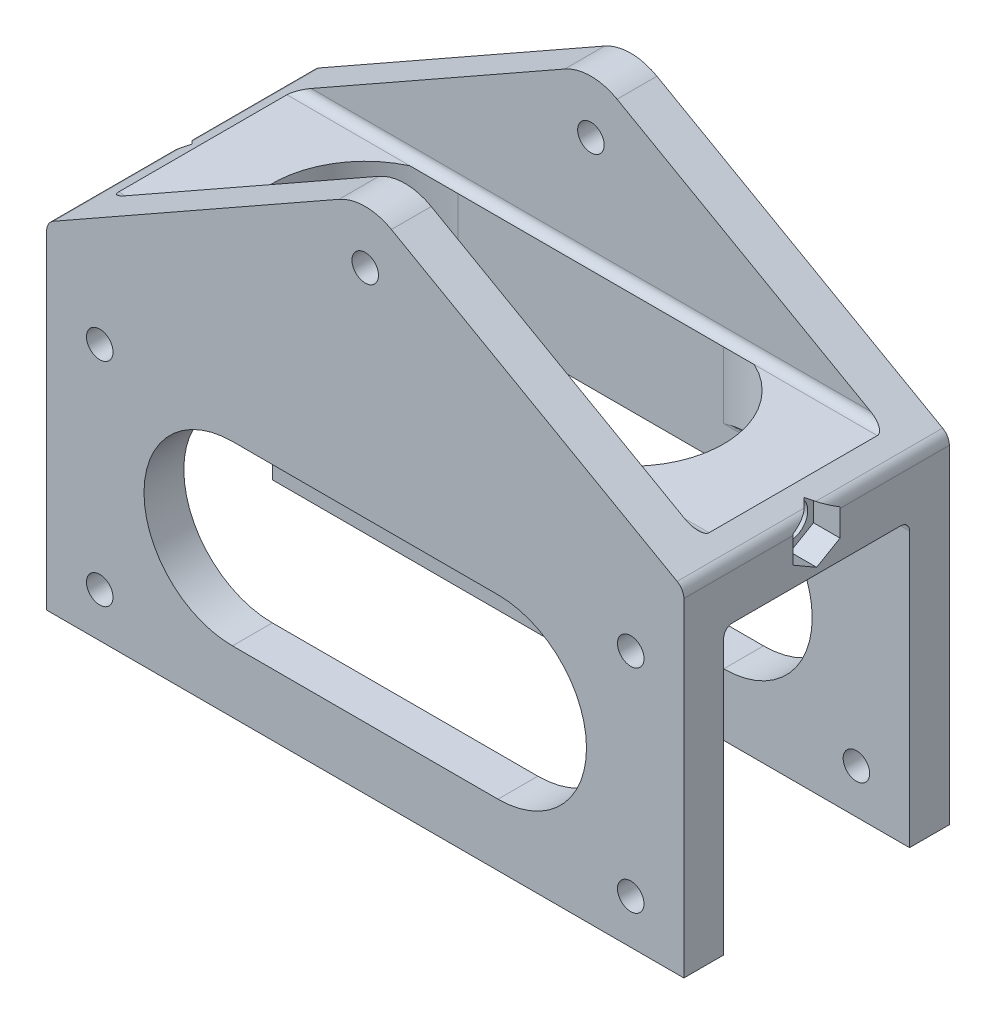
ISO-10303-21;
HEADER;
FILE_DESCRIPTION(('STEP AP214'),'2;1');
FILE_NAME('part.step','',(''),(''),'','','');
FILE_SCHEMA(('AUTOMOTIVE_DESIGN { 1 0 10303 214 1 1 1 1 }'));
ENDSEC;
DATA;
#1=APPLICATION_CONTEXT('core data for automotive mechanical design processes');
#2=APPLICATION_PROTOCOL_DEFINITION('international standard','automotive_design',2000,#1);
#3=PRODUCT_CONTEXT('',#1,'mechanical');
#4=PRODUCT('Part','Part','',(#3));
#5=PRODUCT_RELATED_PRODUCT_CATEGORY('part','',(#4));
#6=PRODUCT_DEFINITION_FORMATION('','',#4);
#7=PRODUCT_DEFINITION_CONTEXT('part definition',#1,'design');
#8=PRODUCT_DEFINITION('design','',#6,#7);
#9=PRODUCT_DEFINITION_SHAPE('','',#8);
#10=(LENGTH_UNIT() NAMED_UNIT(*) SI_UNIT(.MILLI.,.METRE.));
#11=(NAMED_UNIT(*) PLANE_ANGLE_UNIT() SI_UNIT($,.RADIAN.));
#12=(NAMED_UNIT(*) SI_UNIT($,.STERADIAN.) SOLID_ANGLE_UNIT());
#13=UNCERTAINTY_MEASURE_WITH_UNIT(LENGTH_MEASURE(1.E-05),#10,'distance_accuracy_value','');
#14=(GEOMETRIC_REPRESENTATION_CONTEXT(3) GLOBAL_UNCERTAINTY_ASSIGNED_CONTEXT((#13)) GLOBAL_UNIT_ASSIGNED_CONTEXT((#10,
#11,#12)) REPRESENTATION_CONTEXT('',''));
#15=CARTESIAN_POINT('',(0.,0.,0.));
#16=DIRECTION('',(0.,0.,1.));
#17=DIRECTION('',(1.,0.,0.));
#18=AXIS2_PLACEMENT_3D('',#15,#16,#17);
#19=CARTESIAN_POINT('',(-71.9999999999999,45.,-21.));
#20=DIRECTION('',(0.,-1.,0.));
#21=DIRECTION('',(0.,0.,-1.));
#22=AXIS2_PLACEMENT_3D('',#19,#20,#21);
#23=PLANE('',#22);
#24=DIRECTION('',(1.,0.,0.));
#25=VECTOR('',#24,1.);
#26=CARTESIAN_POINT('',(-66.7048574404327,45.,-19.));
#27=LINE('',#26,#25);
#28=CARTESIAN_POINT('',(66.704857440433,45.,-19.));
#29=VERTEX_POINT('',#28);
#30=CARTESIAN_POINT('',(38.9442719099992,45.,-19.));
#31=VERTEX_POINT('',#30);
#32=EDGE_CURVE('E608',#29,#31,#27,.F.);
#33=ORIENTED_EDGE('',*,*,#32,.T.);
#34=CARTESIAN_POINT('',(30.,45.,0.));
#35=DIRECTION('',(0.,1.,0.));
#36=DIRECTION('',(0.,0.,1.));
#37=AXIS2_PLACEMENT_3D('',#34,#35,#36);
#38=CIRCLE('',#37,21.);
#39=CARTESIAN_POINT('',(38.9442719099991,45.,19.));
#40=VERTEX_POINT('',#39);
#41=EDGE_CURVE('E380',#40,#31,#38,.T.);
#42=ORIENTED_EDGE('',*,*,#41,.F.);
#43=DIRECTION('',(1.,0.,0.));
#44=VECTOR('',#43,1.);
#45=CARTESIAN_POINT('',(66.704857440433,45.,19.));
#46=LINE('',#45,#44);
#47=CARTESIAN_POINT('',(66.704857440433,45.,19.));
#48=VERTEX_POINT('',#47);
#49=EDGE_CURVE('E606',#40,#48,#46,.T.);
#50=ORIENTED_EDGE('',*,*,#49,.T.);
#51=DIRECTION('',(0.,0.,1.));
#52=VECTOR('',#51,1.);
#53=CARTESIAN_POINT('',(66.704857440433,45.,30.));
#54=LINE('',#53,#52);
#55=EDGE_CURVE('E935',#29,#48,#54,.T.);
#56=ORIENTED_EDGE('',*,*,#55,.F.);
#57=EDGE_LOOP('',(#33,#42,#50,#56));
#58=FACE_BOUND('',#57,.T.);
#59=ADVANCED_FACE('F32',(#58),#23,.F.);
#60=CARTESIAN_POINT('',(-71.9999999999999,30.,-21.));
#61=DIRECTION('',(0.,1.,0.));
#62=DIRECTION('',(0.,0.,1.));
#63=AXIS2_PLACEMENT_3D('',#60,#61,#62);
#64=PLANE('',#63);
#65=DIRECTION('',(1.,0.,0.));
#66=VECTOR('',#65,1.);
#67=CARTESIAN_POINT('',(-71.9999999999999,30.,19.));
#68=LINE('',#67,#66);
#69=CARTESIAN_POINT('',(72.0000000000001,30.,19.));
#70=VERTEX_POINT('',#69);
#71=CARTESIAN_POINT('',(38.9442719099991,30.,19.));
#72=VERTEX_POINT('',#71);
#73=EDGE_CURVE('E709',#70,#72,#68,.F.);
#74=ORIENTED_EDGE('',*,*,#73,.T.);
#75=CARTESIAN_POINT('',(30.,30.,0.));
#76=DIRECTION('',(0.,1.,0.));
#77=DIRECTION('',(0.,0.,1.));
#78=AXIS2_PLACEMENT_3D('',#75,#76,#77);
#79=CIRCLE('',#78,21.);
#80=CARTESIAN_POINT('',(38.9442719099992,30.,-19.));
#81=VERTEX_POINT('',#80);
#82=EDGE_CURVE('E435',#72,#81,#79,.T.);
#83=ORIENTED_EDGE('',*,*,#82,.T.);
#84=DIRECTION('',(1.,0.,0.));
#85=VECTOR('',#84,1.);
#86=CARTESIAN_POINT('',(72.0000000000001,30.,-19.));
#87=LINE('',#86,#85);
#88=CARTESIAN_POINT('',(72.0000000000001,30.,-19.));
#89=VERTEX_POINT('',#88);
#90=EDGE_CURVE('E704',#81,#89,#87,.T.);
#91=ORIENTED_EDGE('',*,*,#90,.T.);
#92=DIRECTION('',(0.,0.,1.));
#93=VECTOR('',#92,1.);
#94=CARTESIAN_POINT('',(72.0000000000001,30.,-21.));
#95=LINE('',#94,#93);
#96=EDGE_CURVE('E943',#89,#70,#95,.T.);
#97=ORIENTED_EDGE('',*,*,#96,.T.);
#98=EDGE_LOOP('',(#74,#83,#91,#97));
#99=FACE_BOUND('',#98,.T.);
#100=ADVANCED_FACE('F478',(#99),#64,.F.);
#101=CARTESIAN_POINT('',(-71.9999999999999,28.,19.));
#102=DIRECTION('',(-1.,0.,0.));
#103=DIRECTION('',(0.,0.,1.));
#104=AXIS2_PLACEMENT_3D('',#101,#102,#103);
#105=CYLINDRICAL_SURFACE('',#104,2.);
#106=DIRECTION('',(1.,0.,0.));
#107=VECTOR('',#106,1.);
#108=CARTESIAN_POINT('',(72.0000000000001,28.,21.));
#109=LINE('',#108,#107);
#110=CARTESIAN_POINT('',(30.,28.,21.));
#111=VERTEX_POINT('',#110);
#112=CARTESIAN_POINT('',(72.0000000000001,28.,21.));
#113=VERTEX_POINT('',#112);
#114=EDGE_CURVE('E700',#111,#113,#109,.T.);
#115=ORIENTED_EDGE('',*,*,#114,.F.);
#116=CARTESIAN_POINT('',(38.9442719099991,30.,19.));
#117=CARTESIAN_POINT('',(38.7924988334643,29.9999669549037,19.071451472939));
#118=CARTESIAN_POINT('',(38.6399048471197,29.9961728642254,19.1410597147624));
#119=CARTESIAN_POINT('',(38.3334125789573,29.981976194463,19.2764687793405));
#120=CARTESIAN_POINT('',(38.1795148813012,29.9715764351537,19.3422712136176));
#121=CARTESIAN_POINT('',(37.8709182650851,29.9451057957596,19.4698866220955));
#122=CARTESIAN_POINT('',(37.7162214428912,29.9290458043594,19.5317069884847));
#123=CARTESIAN_POINT('',(37.4059130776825,29.8919621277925,19.6514660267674));
#124=CARTESIAN_POINT('',(37.2503014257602,29.870937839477,19.7094042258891));
#125=CARTESIAN_POINT('',(36.7836145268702,29.801560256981,19.8769088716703));
#126=CARTESIAN_POINT('',(36.4713947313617,29.7467805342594,19.9806989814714));
#127=CARTESIAN_POINT('',(35.8447300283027,29.6239653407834,20.172919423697));
#128=CARTESIAN_POINT('',(35.5302838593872,29.5559216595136,20.2613401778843));
#129=CARTESIAN_POINT('',(34.7860949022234,29.3832400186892,20.4521229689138));
#130=CARTESIAN_POINT('',(34.3556836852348,29.2742562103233,20.5480060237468));
#131=CARTESIAN_POINT('',(33.4931935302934,29.0434593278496,20.7120851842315));
#132=CARTESIAN_POINT('',(33.0611144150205,28.92164485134,20.780278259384));
#133=CARTESIAN_POINT('',(31.7629853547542,28.5440774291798,20.9440304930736));
#134=CARTESIAN_POINT('',(30.8947437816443,28.2761240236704,20.9988386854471));
#135=CARTESIAN_POINT('',(30.0184625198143,28.0056976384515,20.9999939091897));
#136=CARTESIAN_POINT('',(30.0092311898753,28.0028487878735,20.9999999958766));
#137=CARTESIAN_POINT('',(30.,28.,21.));
#138=B_SPLINE_CURVE_WITH_KNOTS('',3,(#116,#117,#118,#119,#120,#121,#122,#123,#124,#125,#126,
#127,#128,#129,#130,#131,#132,#133,#134,#135,#136,#137),.UNSPECIFIED.,.F.,.F.,(4,2,2,2,2,2,2,2,
2,2,4),(0.,0.50313785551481,1.00606107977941,1.50802205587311,2.0100440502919,3.00988677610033,
4.01035039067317,5.37175479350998,6.73330815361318,9.45546497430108,9.48444773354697),.UNSPECIFIED.);
#139=EDGE_CURVE('E450',#111,#72,#138,.F.);
#140=ORIENTED_EDGE('',*,*,#139,.T.);
#141=ORIENTED_EDGE('',*,*,#73,.F.);
#142=CARTESIAN_POINT('',(72.0000000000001,28.,19.));
#143=DIRECTION('',(-1.,0.,0.));
#144=DIRECTION('',(0.,-1.,0.));
#145=AXIS2_PLACEMENT_3D('',#142,#143,#144);
#146=CIRCLE('',#145,2.);
#147=EDGE_CURVE('E616',#113,#70,#146,.T.);
#148=ORIENTED_EDGE('',*,*,#147,.F.);
#149=EDGE_LOOP('',(#115,#140,#141,#148));
#150=FACE_BOUND('',#149,.T.);
#151=ADVANCED_FACE('F583',(#150),#105,.F.);
#152=CARTESIAN_POINT('',(-71.9999999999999,28.,-19.));
#153=DIRECTION('',(-1.,0.,0.));
#154=DIRECTION('',(0.,0.,1.));
#155=AXIS2_PLACEMENT_3D('',#152,#153,#154);
#156=CYLINDRICAL_SURFACE('',#155,2.);
#157=ORIENTED_EDGE('',*,*,#90,.F.);
#158=CARTESIAN_POINT('',(38.9442719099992,30.,-19.));
#159=CARTESIAN_POINT('',(38.7924988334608,29.9999669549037,-19.0714514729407));
#160=CARTESIAN_POINT('',(38.6399048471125,29.9961728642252,-19.1410597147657));
#161=CARTESIAN_POINT('',(38.3334125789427,29.9819761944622,-19.2764687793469));
#162=CARTESIAN_POINT('',(38.1795148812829,29.9715764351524,-19.3422712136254));
#163=CARTESIAN_POINT('',(37.8709182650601,29.9451057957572,-19.4698866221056));
#164=CARTESIAN_POINT('',(37.7162214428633,29.9290458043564,-19.5317069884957));
#165=CARTESIAN_POINT('',(37.4059130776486,29.8919621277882,-19.6514660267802));
#166=CARTESIAN_POINT('',(37.2503014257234,29.8709378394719,-19.7094042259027));
#167=CARTESIAN_POINT('',(36.7836145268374,29.8015602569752,-19.8769088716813));
#168=CARTESIAN_POINT('',(36.4713947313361,29.7467805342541,-19.9806989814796));
#169=CARTESIAN_POINT('',(35.8447300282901,29.6239653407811,-20.1729194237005));
#170=CARTESIAN_POINT('',(35.5302838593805,29.555921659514,-20.2613401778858));
#171=CARTESIAN_POINT('',(34.7860949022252,29.3832400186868,-20.4521229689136));
#172=CARTESIAN_POINT('',(34.3556836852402,29.2742562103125,-20.5480060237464));
#173=CARTESIAN_POINT('',(33.4931935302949,29.0434593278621,-20.7120851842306));
#174=CARTESIAN_POINT('',(33.0611144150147,28.9216448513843,-20.7802782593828));
#175=CARTESIAN_POINT('',(31.7629853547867,28.5440774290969,-20.9440304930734));
#176=CARTESIAN_POINT('',(30.8947437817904,28.276124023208,-20.9988386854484));
#177=CARTESIAN_POINT('',(30.0184625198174,28.0056976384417,-20.9999939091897));
#178=CARTESIAN_POINT('',(30.0092311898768,28.0028487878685,-20.9999999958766));
#179=CARTESIAN_POINT('',(30.,28.,-21.));
#180=B_SPLINE_CURVE_WITH_KNOTS('',3,(#158,#159,#160,#161,#162,#163,#164,#165,#166,#167,#168,
#169,#170,#171,#172,#173,#174,#175,#176,#177,#178,#179),.UNSPECIFIED.,.F.,.F.,(4,2,2,2,2,2,2,2,
2,2,4),(0.,0.503137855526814,1.00606107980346,1.50802205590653,2.01004405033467,
3.00988677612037,4.01035039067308,5.37175479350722,6.73330815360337,9.4554649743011,
9.48444773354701),.UNSPECIFIED.);
#181=CARTESIAN_POINT('',(30.,28.,-21.));
#182=VERTEX_POINT('',#181);
#183=EDGE_CURVE('E429',#81,#182,#180,.T.);
#184=ORIENTED_EDGE('',*,*,#183,.T.);
#185=DIRECTION('',(1.,0.,0.));
#186=VECTOR('',#185,1.);
#187=CARTESIAN_POINT('',(-71.9999999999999,28.,-21.));
#188=LINE('',#187,#186);
#189=CARTESIAN_POINT('',(72.0000000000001,28.,-21.));
#190=VERTEX_POINT('',#189);
#191=EDGE_CURVE('E369',#190,#182,#188,.F.);
#192=ORIENTED_EDGE('',*,*,#191,.F.);
#193=CARTESIAN_POINT('',(72.0000000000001,28.,-19.));
#194=DIRECTION('',(-1.,0.,0.));
#195=DIRECTION('',(0.,-1.,0.));
#196=AXIS2_PLACEMENT_3D('',#193,#194,#195);
#197=CIRCLE('',#196,2.);
#198=EDGE_CURVE('E620',#89,#190,#197,.T.);
#199=ORIENTED_EDGE('',*,*,#198,.F.);
#200=EDGE_LOOP('',(#157,#184,#192,#199));
#201=FACE_BOUND('',#200,.T.);
#202=ADVANCED_FACE('F424',(#201),#156,.F.);
#203=CARTESIAN_POINT('',(71.9999999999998,-34.,30.));
#204=DIRECTION('',(-1.,0.,0.));
#205=DIRECTION('',(0.,-1.,0.));
#206=AXIS2_PLACEMENT_3D('',#203,#204,#205);
#207=PLANE('',#206);
#208=DIRECTION('',(0.,-1.,0.));
#209=VECTOR('',#208,1.);
#210=CARTESIAN_POINT('',(71.9999999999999,40.559956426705,-5.30000000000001));
#211=LINE('',#210,#209);
#212=CARTESIAN_POINT('',(71.9999999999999,40.2516452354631,-5.30000000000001));
#213=VERTEX_POINT('',#212);
#214=CARTESIAN_POINT('',(71.9999999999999,34.440043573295,-5.30000000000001));
#215=VERTEX_POINT('',#214);
#216=EDGE_CURVE('E1038',#213,#215,#211,.T.);
#217=ORIENTED_EDGE('',*,*,#216,.T.);
#218=DIRECTION('',(0.,-0.5,0.866025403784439));
#219=VECTOR('',#218,1.);
#220=CARTESIAN_POINT('',(71.9999999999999,34.440043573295,-5.30000000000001));
#221=LINE('',#220,#219);
#222=CARTESIAN_POINT('',(71.9999999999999,31.38008714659,0.));
#223=VERTEX_POINT('',#222);
#224=EDGE_CURVE('E1040',#215,#223,#221,.T.);
#225=ORIENTED_EDGE('',*,*,#224,.T.);
#226=DIRECTION('',(0.,0.5,0.866025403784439));
#227=VECTOR('',#226,1.);
#228=CARTESIAN_POINT('',(71.9999999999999,31.38008714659,0.));
#229=LINE('',#228,#227);
#230=CARTESIAN_POINT('',(71.9999999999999,34.440043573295,5.3));
#231=VERTEX_POINT('',#230);
#232=EDGE_CURVE('E673',#223,#231,#229,.T.);
#233=ORIENTED_EDGE('',*,*,#232,.T.);
#234=DIRECTION('',(0.,1.,0.));
#235=VECTOR('',#234,1.);
#236=CARTESIAN_POINT('',(71.9999999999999,34.440043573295,5.3));
#237=LINE('',#236,#235);
#238=CARTESIAN_POINT('',(71.9999999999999,40.2516452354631,5.3));
#239=VERTEX_POINT('',#238);
#240=EDGE_CURVE('E460',#231,#239,#237,.T.);
#241=ORIENTED_EDGE('',*,*,#240,.T.);
#242=DIRECTION('',(0.,0.,-1.));
#243=VECTOR('',#242,1.);
#244=CARTESIAN_POINT('',(72.0000000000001,40.2516452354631,30.));
#245=LINE('',#244,#243);
#246=CARTESIAN_POINT('',(72.0000000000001,40.2516452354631,30.));
#247=VERTEX_POINT('',#246);
#248=EDGE_CURVE('E669',#247,#239,#245,.T.);
#249=ORIENTED_EDGE('',*,*,#248,.F.);
#250=DIRECTION('',(0.,1.,0.));
#251=VECTOR('',#250,1.);
#252=CARTESIAN_POINT('',(71.9999999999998,-34.,30.));
#253=LINE('',#252,#251);
#254=CARTESIAN_POINT('',(71.9999999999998,-34.,30.));
#255=VERTEX_POINT('',#254);
#256=EDGE_CURVE('E844',#255,#247,#253,.T.);
#257=ORIENTED_EDGE('',*,*,#256,.F.);
#258=DIRECTION('',(0.,0.,-1.));
#259=VECTOR('',#258,1.);
#260=CARTESIAN_POINT('',(71.9999999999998,-34.,30.));
#261=LINE('',#260,#259);
#262=CARTESIAN_POINT('',(72.0000000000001,-34.,21.));
#263=VERTEX_POINT('',#262);
#264=EDGE_CURVE('E680',#255,#263,#261,.T.);
#265=ORIENTED_EDGE('',*,*,#264,.T.);
#266=DIRECTION('',(0.,-1.,0.));
#267=VECTOR('',#266,1.);
#268=CARTESIAN_POINT('',(72.0000000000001,-42.,21.));
#269=LINE('',#268,#267);
#270=EDGE_CURVE('E938',#113,#263,#269,.T.);
#271=ORIENTED_EDGE('',*,*,#270,.F.);
#272=ORIENTED_EDGE('',*,*,#147,.T.);
#273=ORIENTED_EDGE('',*,*,#96,.F.);
#274=ORIENTED_EDGE('',*,*,#198,.T.);
#275=DIRECTION('',(0.,1.,0.));
#276=VECTOR('',#275,1.);
#277=CARTESIAN_POINT('',(72.0000000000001,-42.,-21.));
#278=LINE('',#277,#276);
#279=CARTESIAN_POINT('',(72.0000000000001,-34.,-21.));
#280=VERTEX_POINT('',#279);
#281=EDGE_CURVE('E941',#280,#190,#278,.T.);
#282=ORIENTED_EDGE('',*,*,#281,.F.);
#283=CARTESIAN_POINT('',(71.9999999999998,-34.,-30.));
#284=VERTEX_POINT('',#283);
#285=EDGE_CURVE('E677',#280,#284,#261,.T.);
#286=ORIENTED_EDGE('',*,*,#285,.T.);
#287=DIRECTION('',(0.,1.,0.));
#288=VECTOR('',#287,1.);
#289=CARTESIAN_POINT('',(71.9999999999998,-34.,-30.));
#290=LINE('',#289,#288);
#291=CARTESIAN_POINT('',(72.0000000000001,40.2516452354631,-30.));
#292=VERTEX_POINT('',#291);
#293=EDGE_CURVE('E860',#284,#292,#290,.T.);
#294=ORIENTED_EDGE('',*,*,#293,.T.);
#295=EDGE_CURVE('E678',#213,#292,#245,.T.);
#296=ORIENTED_EDGE('',*,*,#295,.F.);
#297=EDGE_LOOP('',(#217,#225,#233,#241,#249,#257,#265,#271,#272,#273,#274,#282,#286,#294,#296));
#298=FACE_BOUND('',#297,.T.);
#299=ADVANCED_FACE('F565',(#298),#207,.F.);
#300=CARTESIAN_POINT('',(68.9999999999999,40.2516452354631,30.));
#301=DIRECTION('',(0.,0.,-1.));
#302=DIRECTION('',(-1.,0.,0.));
#303=AXIS2_PLACEMENT_3D('',#300,#301,#302);
#304=CYLINDRICAL_SURFACE('',#303,3.00000000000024);
#305=CARTESIAN_POINT('',(68.9999999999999,40.2516452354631,-5.83401064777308));
#306=DIRECTION('',(0.,-0.866025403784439,0.5));
#307=DIRECTION('',(0.,-0.5,-0.866025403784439));
#308=AXIS2_PLACEMENT_3D('',#305,#306,#307);
#309=ELLIPSE('',#308,6.00000000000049,3.00000000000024);
#310=CARTESIAN_POINT('',(71.984115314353,40.559956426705,-5.30000000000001));
#311=VERTEX_POINT('',#310);
#312=CARTESIAN_POINT('',(70.478821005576,42.8618345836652,-1.3130300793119));
#313=VERTEX_POINT('',#312);
#314=EDGE_CURVE('E650',#311,#313,#309,.T.);
#315=ORIENTED_EDGE('',*,*,#314,.F.);
#316=CARTESIAN_POINT('',(68.9999999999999,40.2516452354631,-5.30000000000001));
#317=DIRECTION('',(0.,0.,1.));
#318=DIRECTION('',(0.,-1.,0.));
#319=AXIS2_PLACEMENT_3D('',#316,#317,#318);
#320=CIRCLE('',#319,3.00000000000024);
#321=EDGE_CURVE('E11',#213,#311,#320,.T.);
#322=ORIENTED_EDGE('',*,*,#321,.F.);
#323=ORIENTED_EDGE('',*,*,#295,.T.);
#324=CARTESIAN_POINT('',(68.9999999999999,40.2516452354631,-30.));
#325=DIRECTION('',(0.,0.,1.));
#326=DIRECTION('',(1.,0.,0.));
#327=AXIS2_PLACEMENT_3D('',#324,#325,#326);
#328=CIRCLE('',#327,3.00000000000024);
#329=CARTESIAN_POINT('',(70.478821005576,42.8618345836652,-30.));
#330=VERTEX_POINT('',#329);
#331=EDGE_CURVE('E863',#292,#330,#328,.T.);
#332=ORIENTED_EDGE('',*,*,#331,.T.);
#333=DIRECTION('',(0.,0.,-1.));
#334=VECTOR('',#333,1.);
#335=CARTESIAN_POINT('',(70.478821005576,42.8618345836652,30.));
#336=LINE('',#335,#334);
#337=EDGE_CURVE('E895',#313,#330,#336,.T.);
#338=ORIENTED_EDGE('',*,*,#337,.F.);
#339=EDGE_LOOP('',(#315,#322,#323,#332,#338));
#340=FACE_BOUND('',#339,.T.);
#341=ADVANCED_FACE('F562',(#340),#304,.T.);
#342=CARTESIAN_POINT('',(68.9999999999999,40.2516452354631,5.83401064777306));
#343=DIRECTION('',(0.,-0.866025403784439,-0.5));
#344=DIRECTION('',(0.,0.5,-0.866025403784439));
#345=AXIS2_PLACEMENT_3D('',#342,#343,#344);
#346=ELLIPSE('',#345,6.00000000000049,3.00000000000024);
#347=CARTESIAN_POINT('',(70.478821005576,42.8618345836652,1.31303007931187));
#348=VERTEX_POINT('',#347);
#349=CARTESIAN_POINT('',(71.984115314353,40.559956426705,5.3));
#350=VERTEX_POINT('',#349);
#351=EDGE_CURVE('E1011',#348,#350,#346,.T.);
#352=ORIENTED_EDGE('',*,*,#351,.F.);
#353=CARTESIAN_POINT('',(70.478821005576,42.8618345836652,30.));
#354=VERTEX_POINT('',#353);
#355=EDGE_CURVE('E682',#354,#348,#336,.T.);
#356=ORIENTED_EDGE('',*,*,#355,.F.);
#357=CARTESIAN_POINT('',(68.9999999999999,40.2516452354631,30.));
#358=DIRECTION('',(0.,0.,1.));
#359=DIRECTION('',(1.,0.,0.));
#360=AXIS2_PLACEMENT_3D('',#357,#358,#359);
#361=CIRCLE('',#360,3.00000000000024);
#362=EDGE_CURVE('E676',#247,#354,#361,.T.);
#363=ORIENTED_EDGE('',*,*,#362,.F.);
#364=ORIENTED_EDGE('',*,*,#248,.T.);
#365=CARTESIAN_POINT('',(68.9999999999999,40.2516452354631,5.3));
#366=DIRECTION('',(0.,0.,-1.));
#367=DIRECTION('',(-1.,0.,0.));
#368=AXIS2_PLACEMENT_3D('',#365,#366,#367);
#369=CIRCLE('',#368,3.00000000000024);
#370=EDGE_CURVE('E40',#350,#239,#369,.T.);
#371=ORIENTED_EDGE('',*,*,#370,.F.);
#372=EDGE_LOOP('',(#352,#356,#363,#364,#371));
#373=FACE_BOUND('',#372,.T.);
#374=ADVANCED_FACE('F560',(#373),#304,.T.);
#375=CARTESIAN_POINT('',(5.91528402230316,79.4407573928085,30.));
#376=DIRECTION('',(-0.49294033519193,-0.870063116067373,0.));
#377=DIRECTION('',(0.870063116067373,-0.49294033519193,0.));
#378=AXIS2_PLACEMENT_3D('',#375,#376,#377);
#379=PLANE('',#378);
#380=DIRECTION('',(0.661693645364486,-0.374887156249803,0.649323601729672));
#381=VECTOR('',#380,1.);
#382=CARTESIAN_POINT('',(45.462087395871,57.0352397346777,-23.2360277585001));
#383=LINE('',#382,#381);
#384=CARTESIAN_POINT('',(69.1407768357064,43.61991285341,0.));
#385=VERTEX_POINT('',#384);
#386=EDGE_CURVE('E653',#385,#348,#383,.T.);
#387=ORIENTED_EDGE('',*,*,#386,.F.);
#388=DIRECTION('',(-0.661693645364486,0.374887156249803,0.649323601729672));
#389=VECTOR('',#388,1.);
#390=CARTESIAN_POINT('',(19.6828893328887,71.6406244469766,48.5332961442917));
#391=LINE('',#390,#389);
#392=EDGE_CURVE('E641',#313,#385,#391,.T.);
#393=ORIENTED_EDGE('',*,*,#392,.F.);
#394=ORIENTED_EDGE('',*,*,#337,.T.);
#395=DIRECTION('',(-0.870063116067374,0.49294033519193,0.));
#396=VECTOR('',#395,1.);
#397=CARTESIAN_POINT('',(5.91528402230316,79.4407573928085,-30.));
#398=LINE('',#397,#396);
#399=CARTESIAN_POINT('',(5.91528402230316,79.4407573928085,-30.));
#400=VERTEX_POINT('',#399);
#401=EDGE_CURVE('E866',#330,#400,#398,.T.);
#402=ORIENTED_EDGE('',*,*,#401,.T.);
#403=DIRECTION('',(0.,0.,-1.));
#404=VECTOR('',#403,1.);
#405=CARTESIAN_POINT('',(5.91528402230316,79.4407573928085,30.));
#406=LINE('',#405,#404);
#407=CARTESIAN_POINT('',(5.91528402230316,79.4407573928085,-21.));
#408=VERTEX_POINT('',#407);
#409=EDGE_CURVE('E892',#408,#400,#406,.T.);
#410=ORIENTED_EDGE('',*,*,#409,.F.);
#411=DIRECTION('',(0.870063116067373,-0.49294033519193,0.));
#412=VECTOR('',#411,1.);
#413=CARTESIAN_POINT('',(5.91528402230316,79.4407573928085,-21.));
#414=LINE('',#413,#412);
#415=CARTESIAN_POINT('',(63.1747624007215,47.,-21.));
#416=VERTEX_POINT('',#415);
#417=EDGE_CURVE('E698',#408,#416,#414,.T.);
#418=ORIENTED_EDGE('',*,*,#417,.T.);
#419=CARTESIAN_POINT('',(63.1747624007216,47.,-19.));
#420=DIRECTION('',(-0.49294033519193,-0.870063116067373,0.));
#421=DIRECTION('',(-0.870063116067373,0.49294033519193,0.));
#422=AXIS2_PLACEMENT_3D('',#419,#420,#421);
#423=ELLIPSE('',#422,4.05728616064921,2.);
#424=EDGE_CURVE('E624',#416,#29,#423,.T.);
#425=ORIENTED_EDGE('',*,*,#424,.T.);
#426=ORIENTED_EDGE('',*,*,#55,.T.);
#427=CARTESIAN_POINT('',(63.1747624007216,47.,19.));
#428=DIRECTION('',(-0.49294033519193,-0.870063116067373,0.));
#429=DIRECTION('',(-0.870063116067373,0.49294033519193,0.));
#430=AXIS2_PLACEMENT_3D('',#427,#428,#429);
#431=ELLIPSE('',#430,4.05728616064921,2.);
#432=CARTESIAN_POINT('',(63.1747624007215,47.,21.));
#433=VERTEX_POINT('',#432);
#434=EDGE_CURVE('E628',#48,#433,#431,.T.);
#435=ORIENTED_EDGE('',*,*,#434,.T.);
#436=DIRECTION('',(-0.870063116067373,0.49294033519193,0.));
#437=VECTOR('',#436,1.);
#438=CARTESIAN_POINT('',(5.91528402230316,79.4407573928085,21.));
#439=LINE('',#438,#437);
#440=CARTESIAN_POINT('',(5.91528402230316,79.4407573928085,21.));
#441=VERTEX_POINT('',#440);
#442=EDGE_CURVE('E933',#433,#441,#439,.T.);
#443=ORIENTED_EDGE('',*,*,#442,.T.);
#444=CARTESIAN_POINT('',(5.91528402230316,79.4407573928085,30.));
#445=VERTEX_POINT('',#444);
#446=EDGE_CURVE('E893',#445,#441,#406,.T.);
#447=ORIENTED_EDGE('',*,*,#446,.F.);
#448=DIRECTION('',(-0.870063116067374,0.49294033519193,0.));
#449=VECTOR('',#448,1.);
#450=CARTESIAN_POINT('',(5.91528402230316,79.4407573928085,30.));
#451=LINE('',#450,#449);
#452=EDGE_CURVE('E848',#354,#445,#451,.T.);
#453=ORIENTED_EDGE('',*,*,#452,.F.);
#454=ORIENTED_EDGE('',*,*,#355,.T.);
#455=EDGE_LOOP('',(#387,#393,#394,#402,#410,#418,#425,#426,#435,#443,#447,#453,#454));
#456=FACE_BOUND('',#455,.T.);
#457=ADVANCED_FACE('F469',(#456),#379,.F.);
#458=CARTESIAN_POINT('',(-71.9999999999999,37.5,0.));
#459=DIRECTION('',(1.,0.,0.));
#460=DIRECTION('',(0.,0.,-1.));
#461=AXIS2_PLACEMENT_3D('',#458,#459,#460);
#462=CYLINDRICAL_SURFACE('',#461,4.);
#463=CARTESIAN_POINT('',(50.6155281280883,37.5,-4.00000000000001));
#464=CARTESIAN_POINT('',(50.6155324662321,37.2775159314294,-3.99999153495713));
#465=CARTESIAN_POINT('',(50.6191688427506,37.0549227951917,-3.9813748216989));
#466=CARTESIAN_POINT('',(50.6333025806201,36.6160178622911,-3.90745280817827));
#467=CARTESIAN_POINT('',(50.6438056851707,36.3997114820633,-3.85211679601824));
#468=CARTESIAN_POINT('',(50.670441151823,35.9797939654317,-3.70652120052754));
#469=CARTESIAN_POINT('',(50.6865681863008,35.7761710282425,-3.61629466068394));
#470=CARTESIAN_POINT('',(50.7226280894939,35.386963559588,-3.40356743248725));
#471=CARTESIAN_POINT('',(50.7425606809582,35.2013777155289,-3.28106909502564));
#472=CARTESIAN_POINT('',(50.7842716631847,34.8511168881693,-3.00559908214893));
#473=CARTESIAN_POINT('',(50.8060686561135,34.6867071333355,-2.85229293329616));
#474=CARTESIAN_POINT('',(50.8488883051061,34.3857774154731,-2.52028192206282));
#475=CARTESIAN_POINT('',(50.8699109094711,34.2492593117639,-2.34157536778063));
#476=CARTESIAN_POINT('',(50.909012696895,34.0069687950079,-1.96209093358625));
#477=CARTESIAN_POINT('',(50.9270674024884,33.9014469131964,-1.76115035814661));
#478=CARTESIAN_POINT('',(50.9579907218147,33.7257589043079,-1.34399149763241));
#479=CARTESIAN_POINT('',(50.9708597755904,33.6555897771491,-1.12777451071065));
#480=CARTESIAN_POINT('',(50.9898304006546,33.5534205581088,-0.688949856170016));
#481=CARTESIAN_POINT('',(50.996011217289,33.5209731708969,-0.466449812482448));
#482=CARTESIAN_POINT('',(51.0011822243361,33.4937743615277,-0.0190839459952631));
#483=CARTESIAN_POINT('',(51.0001730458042,33.4990196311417,0.205781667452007));
#484=CARTESIAN_POINT('',(50.9911395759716,33.5467150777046,0.648426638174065));
#485=CARTESIAN_POINT('',(50.9832061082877,33.5886835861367,0.86626001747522));
#486=CARTESIAN_POINT('',(50.9613174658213,33.7078718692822,1.29173491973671));
#487=CARTESIAN_POINT('',(50.9473620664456,33.7850929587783,1.49937606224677));
#488=CARTESIAN_POINT('',(50.9148462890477,33.9730503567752,1.89996408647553));
#489=CARTESIAN_POINT('',(50.896259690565,34.0839783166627,2.0928188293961));
#490=CARTESIAN_POINT('',(50.8565354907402,34.3360592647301,2.45735639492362));
#491=CARTESIAN_POINT('',(50.8353976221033,34.4772154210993,2.62903699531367));
#492=CARTESIAN_POINT('',(50.7925160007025,34.788397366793,2.94920783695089));
#493=CARTESIAN_POINT('',(50.7707679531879,34.9588445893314,3.09728818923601));
#494=CARTESIAN_POINT('',(50.7294362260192,35.3223688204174,3.36282428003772));
#495=CARTESIAN_POINT('',(50.7098525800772,35.5154461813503,3.48027954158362));
#496=CARTESIAN_POINT('',(50.6750602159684,35.9193038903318,3.68135386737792));
#497=CARTESIAN_POINT('',(50.6598594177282,36.1301154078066,3.76491178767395));
#498=CARTESIAN_POINT('',(50.6356738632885,36.563140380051,3.89530564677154));
#499=CARTESIAN_POINT('',(50.6266883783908,36.7853524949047,3.94214589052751));
#500=CARTESIAN_POINT('',(50.6160954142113,37.2311703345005,3.9971730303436));
#501=CARTESIAN_POINT('',(50.6143754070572,37.4547006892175,4.00594951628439));
#502=CARTESIAN_POINT('',(50.6182068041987,37.9000325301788,3.98618188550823));
#503=CARTESIAN_POINT('',(50.6237578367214,38.1218341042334,3.95763967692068));
#504=CARTESIAN_POINT('',(50.641400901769,38.5554638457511,3.8645515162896));
#505=CARTESIAN_POINT('',(50.6534365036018,38.7673611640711,3.8003160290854));
#506=CARTESIAN_POINT('',(50.6826437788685,39.1773855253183,3.63799472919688));
#507=CARTESIAN_POINT('',(50.699815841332,39.3755115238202,3.53990635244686));
#508=CARTESIAN_POINT('',(50.7376166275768,39.7549625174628,3.31131186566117));
#509=CARTESIAN_POINT('',(50.7582840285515,39.936059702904,3.1804341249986));
#510=CARTESIAN_POINT('',(50.8006386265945,40.2739357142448,2.89047583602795));
#511=CARTESIAN_POINT('',(50.8223259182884,40.4307122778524,2.73139266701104));
#512=CARTESIAN_POINT('',(50.8646391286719,40.7177070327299,2.3869028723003));
#513=CARTESIAN_POINT('',(50.8852462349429,40.8475282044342,2.20116281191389));
#514=CARTESIAN_POINT('',(50.9227582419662,41.0741217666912,1.81016635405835));
#515=CARTESIAN_POINT('',(50.9396632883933,41.1708954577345,1.60491072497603));
#516=CARTESIAN_POINT('',(50.9677856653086,41.3280563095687,1.18179412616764));
#517=CARTESIAN_POINT('',(50.9790331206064,41.3886365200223,0.964006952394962));
#518=CARTESIAN_POINT('',(50.9947017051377,41.4723058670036,0.521114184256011));
#519=CARTESIAN_POINT('',(50.999123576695,41.4953990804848,0.296009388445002));
#520=CARTESIAN_POINT('',(51.000627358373,41.5032932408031,-0.151324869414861));
#521=CARTESIAN_POINT('',(50.9978240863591,41.4886931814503,-0.373543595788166));
#522=CARTESIAN_POINT('',(50.985431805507,41.4229296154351,-0.812299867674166));
#523=CARTESIAN_POINT('',(50.9758428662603,41.3717664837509,-1.02883747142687));
#524=CARTESIAN_POINT('',(50.9509573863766,41.2345847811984,-1.44975498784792));
#525=CARTESIAN_POINT('',(50.93567160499,41.148631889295,-1.65415698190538));
#526=CARTESIAN_POINT('',(50.9010450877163,40.9443832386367,-2.0457263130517));
#527=CARTESIAN_POINT('',(50.8817040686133,40.8260852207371,-2.23289244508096));
#528=CARTESIAN_POINT('',(50.840739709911,40.558452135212,-2.58765662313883));
#529=CARTESIAN_POINT('',(50.8190869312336,40.4086852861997,-2.7549255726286));
#530=CARTESIAN_POINT('',(50.7761226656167,40.0832598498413,-3.06216464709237));
#531=CARTESIAN_POINT('',(50.754811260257,39.9075951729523,-3.20212833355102));
#532=CARTESIAN_POINT('',(50.7147187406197,39.5333417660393,-3.45204959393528));
#533=CARTESIAN_POINT('',(50.6959638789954,39.3345491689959,-3.56170623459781));
#534=CARTESIAN_POINT('',(50.6634248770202,38.9210672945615,-3.74588992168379));
#535=CARTESIAN_POINT('',(50.6496360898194,38.7063931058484,-3.8204498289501));
#536=CARTESIAN_POINT('',(50.631437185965,38.3259322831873,-3.91733139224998));
#537=CARTESIAN_POINT('',(50.625507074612,38.1623601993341,-3.94827845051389));
#538=CARTESIAN_POINT('',(50.6175509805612,37.83254567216,-3.98961562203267));
#539=CARTESIAN_POINT('',(50.6155248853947,37.6663033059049,-4.00000632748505));
#540=CARTESIAN_POINT('',(50.6155281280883,37.5,-4.00000000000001));
#541=B_SPLINE_CURVE_WITH_KNOTS('',3,(#463,#464,#465,#466,#467,#468,#469,#470,#471,#472,#473,
#474,#475,#476,#477,#478,#479,#480,#481,#482,#483,#484,#485,#486,#487,#488,#489,#490,#491,#492,
#493,#494,#495,#496,#497,#498,#499,#500,#501,#502,#503,#504,#505,#506,#507,#508,#509,#510,#511,
#512,#513,#514,#515,#516,#517,#518,#519,#520,#521,#522,#523,#524,#525,#526,#527,#528,#529,#530,
#531,#532,#533,#534,#535,#536,#537,#538,#539,#540),.UNSPECIFIED.,.T.,.F.,(4,2,2,2,2,2,2,2,2,2,2,
2,2,2,2,2,2,2,2,2,2,2,2,2,2,2,2,2,2,2,2,2,2,2,2,2,2,2,4),(0.,0.666843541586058,1.33424553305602,
2.00101699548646,2.66773989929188,3.34213567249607,4.01657638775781,4.69632714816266,
5.3760202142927,6.04756867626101,6.71905819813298,7.38187017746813,8.04470687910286,
8.71138520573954,9.37813344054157,10.0554308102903,10.7327387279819,11.4112629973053,
12.0897077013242,12.7576052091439,13.4254685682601,14.0876116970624,14.7498049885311,
15.4198728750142,16.090003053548,16.769395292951,17.4487607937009,18.1244695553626,
18.8001048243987,19.4650697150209,20.1300277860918,20.7937363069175,21.457491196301,
22.1310297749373,22.8047269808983,23.4848911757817,24.1644172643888,24.6628865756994,
25.161341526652),.UNSPECIFIED.);
#542=CARTESIAN_POINT('',(50.6155281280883,37.5,-4.00000000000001));
#543=VERTEX_POINT('',#542);
#544=EDGE_CURVE('E455',#543,#543,#541,.T.);
#545=ORIENTED_EDGE('',*,*,#544,.T.);
#546=EDGE_LOOP('',(#545));
#547=FACE_BOUND('',#546,.T.);
#548=CARTESIAN_POINT('',(65.9999999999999,37.5,0.));
#549=DIRECTION('',(1.,0.,0.));
#550=DIRECTION('',(0.,0.,-1.));
#551=AXIS2_PLACEMENT_3D('',#548,#549,#550);
#552=CIRCLE('',#551,4.);
#553=CARTESIAN_POINT('',(65.9999999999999,37.5,-4.00000000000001));
#554=VERTEX_POINT('',#553);
#555=EDGE_CURVE('E647',#554,#554,#552,.F.);
#556=ORIENTED_EDGE('',*,*,#555,.F.);
#557=EDGE_LOOP('',(#556));
#558=FACE_BOUND('',#557,.T.);
#559=ADVANCED_FACE('F463',(#547,#558),#462,.F.);
#560=CARTESIAN_POINT('',(-50.6155281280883,37.5,-4.00000000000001));
#561=CARTESIAN_POINT('',(-50.6155324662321,37.7224840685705,-3.99999153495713));
#562=CARTESIAN_POINT('',(-50.6191688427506,37.9450772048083,-3.9813748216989));
#563=CARTESIAN_POINT('',(-50.6333025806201,38.3839821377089,-3.90745280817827));
#564=CARTESIAN_POINT('',(-50.6438056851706,38.6002885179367,-3.85211679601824));
#565=CARTESIAN_POINT('',(-50.670441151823,39.0202060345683,-3.70652120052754));
#566=CARTESIAN_POINT('',(-50.6865681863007,39.2238289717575,-3.61629466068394));
#567=CARTESIAN_POINT('',(-50.7226280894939,39.613036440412,-3.40356743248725));
#568=CARTESIAN_POINT('',(-50.7425606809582,39.7986222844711,-3.28106909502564));
#569=CARTESIAN_POINT('',(-50.7842716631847,40.1488831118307,-3.00559908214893));
#570=CARTESIAN_POINT('',(-50.8060686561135,40.3132928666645,-2.85229293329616));
#571=CARTESIAN_POINT('',(-50.8488883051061,40.6142225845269,-2.52028192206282));
#572=CARTESIAN_POINT('',(-50.8699109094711,40.7507406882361,-2.34157536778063));
#573=CARTESIAN_POINT('',(-50.909012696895,40.9930312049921,-1.96209093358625));
#574=CARTESIAN_POINT('',(-50.9270674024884,41.0985530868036,-1.76115035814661));
#575=CARTESIAN_POINT('',(-50.9579907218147,41.2742410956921,-1.34399149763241));
#576=CARTESIAN_POINT('',(-50.9708597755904,41.3444102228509,-1.12777451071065));
#577=CARTESIAN_POINT('',(-50.9898304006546,41.4465794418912,-0.688949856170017));
#578=CARTESIAN_POINT('',(-50.996011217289,41.4790268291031,-0.466449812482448));
#579=CARTESIAN_POINT('',(-51.0011822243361,41.5062256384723,-0.0190839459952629));
#580=CARTESIAN_POINT('',(-51.0001730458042,41.5009803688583,0.205781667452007));
#581=CARTESIAN_POINT('',(-50.9911395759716,41.4532849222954,0.648426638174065));
#582=CARTESIAN_POINT('',(-50.9832061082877,41.4113164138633,0.86626001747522));
#583=CARTESIAN_POINT('',(-50.9613174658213,41.2921281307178,1.29173491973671));
#584=CARTESIAN_POINT('',(-50.9473620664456,41.2149070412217,1.49937606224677));
#585=CARTESIAN_POINT('',(-50.9148462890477,41.0269496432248,1.89996408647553));
#586=CARTESIAN_POINT('',(-50.896259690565,40.9160216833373,2.0928188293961));
#587=CARTESIAN_POINT('',(-50.8565354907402,40.6639407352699,2.45735639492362));
#588=CARTESIAN_POINT('',(-50.8353976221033,40.5227845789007,2.62903699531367));
#589=CARTESIAN_POINT('',(-50.7925160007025,40.211602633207,2.94920783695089));
#590=CARTESIAN_POINT('',(-50.7707679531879,40.0411554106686,3.09728818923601));
#591=CARTESIAN_POINT('',(-50.7294362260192,39.6776311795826,3.36282428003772));
#592=CARTESIAN_POINT('',(-50.7098525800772,39.4845538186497,3.48027954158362));
#593=CARTESIAN_POINT('',(-50.6750602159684,39.0806961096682,3.68135386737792));
#594=CARTESIAN_POINT('',(-50.6598594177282,38.8698845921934,3.76491178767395));
#595=CARTESIAN_POINT('',(-50.6356738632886,38.436859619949,3.89530564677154));
#596=CARTESIAN_POINT('',(-50.6266883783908,38.2146475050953,3.94214589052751));
#597=CARTESIAN_POINT('',(-50.6160954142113,37.7688296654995,3.9971730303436));
#598=CARTESIAN_POINT('',(-50.6143754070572,37.5452993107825,4.00594951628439));
#599=CARTESIAN_POINT('',(-50.6182068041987,37.0999674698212,3.98618188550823));
#600=CARTESIAN_POINT('',(-50.6237578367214,36.8781658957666,3.95763967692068));
#601=CARTESIAN_POINT('',(-50.641400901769,36.4445361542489,3.8645515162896));
#602=CARTESIAN_POINT('',(-50.6534365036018,36.2326388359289,3.80031602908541));
#603=CARTESIAN_POINT('',(-50.6826437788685,35.8226144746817,3.63799472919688));
#604=CARTESIAN_POINT('',(-50.699815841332,35.6244884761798,3.53990635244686));
#605=CARTESIAN_POINT('',(-50.7376166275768,35.2450374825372,3.31131186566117));
#606=CARTESIAN_POINT('',(-50.7582840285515,35.063940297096,3.1804341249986));
#607=CARTESIAN_POINT('',(-50.8006386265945,34.7260642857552,2.89047583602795));
#608=CARTESIAN_POINT('',(-50.8223259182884,34.5692877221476,2.73139266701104));
#609=CARTESIAN_POINT('',(-50.8646391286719,34.2822929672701,2.3869028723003));
#610=CARTESIAN_POINT('',(-50.8852462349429,34.1524717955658,2.20116281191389));
#611=CARTESIAN_POINT('',(-50.9227582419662,33.9258782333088,1.81016635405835));
#612=CARTESIAN_POINT('',(-50.9396632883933,33.8291045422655,1.60491072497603));
#613=CARTESIAN_POINT('',(-50.9677856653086,33.6719436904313,1.18179412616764));
#614=CARTESIAN_POINT('',(-50.9790331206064,33.6113634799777,0.964006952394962));
#615=CARTESIAN_POINT('',(-50.9947017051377,33.5276941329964,0.521114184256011));
#616=CARTESIAN_POINT('',(-50.999123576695,33.5046009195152,0.296009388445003));
#617=CARTESIAN_POINT('',(-51.000627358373,33.4967067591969,-0.151324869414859));
#618=CARTESIAN_POINT('',(-50.9978240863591,33.5113068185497,-0.373543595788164));
#619=CARTESIAN_POINT('',(-50.985431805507,33.5770703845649,-0.812299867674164));
#620=CARTESIAN_POINT('',(-50.9758428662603,33.6282335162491,-1.02883747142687));
#621=CARTESIAN_POINT('',(-50.9509573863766,33.7654152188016,-1.44975498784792));
#622=CARTESIAN_POINT('',(-50.93567160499,33.851368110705,-1.65415698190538));
#623=CARTESIAN_POINT('',(-50.9010450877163,34.0556167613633,-2.0457263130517));
#624=CARTESIAN_POINT('',(-50.8817040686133,34.1739147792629,-2.23289244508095));
#625=CARTESIAN_POINT('',(-50.840739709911,34.441547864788,-2.58765662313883));
#626=CARTESIAN_POINT('',(-50.8190869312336,34.5913147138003,-2.7549255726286));
#627=CARTESIAN_POINT('',(-50.7761226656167,34.9167401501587,-3.06216464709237));
#628=CARTESIAN_POINT('',(-50.754811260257,35.0924048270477,-3.20212833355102));
#629=CARTESIAN_POINT('',(-50.7147187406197,35.4666582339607,-3.45204959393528));
#630=CARTESIAN_POINT('',(-50.6959638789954,35.6654508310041,-3.56170623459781));
#631=CARTESIAN_POINT('',(-50.6634248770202,36.0789327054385,-3.74588992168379));
#632=CARTESIAN_POINT('',(-50.6496360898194,36.2936068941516,-3.8204498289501));
#633=CARTESIAN_POINT('',(-50.631437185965,36.6740677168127,-3.91733139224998));
#634=CARTESIAN_POINT('',(-50.6255070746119,36.8376398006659,-3.94827845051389));
#635=CARTESIAN_POINT('',(-50.6175509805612,37.16745432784,-3.98961562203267));
#636=CARTESIAN_POINT('',(-50.6155248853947,37.3336966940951,-4.00000632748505));
#637=CARTESIAN_POINT('',(-50.6155281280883,37.5,-4.00000000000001));
#638=B_SPLINE_CURVE_WITH_KNOTS('',3,(#560,#561,#562,#563,#564,#565,#566,#567,#568,#569,#570,
#571,#572,#573,#574,#575,#576,#577,#578,#579,#580,#581,#582,#583,#584,#585,#586,#587,#588,#589,
#590,#591,#592,#593,#594,#595,#596,#597,#598,#599,#600,#601,#602,#603,#604,#605,#606,#607,#608,
#609,#610,#611,#612,#613,#614,#615,#616,#617,#618,#619,#620,#621,#622,#623,#624,#625,#626,#627,
#628,#629,#630,#631,#632,#633,#634,#635,#636,#637),.UNSPECIFIED.,.T.,.F.,(4,2,2,2,2,2,2,2,2,2,2,
2,2,2,2,2,2,2,2,2,2,2,2,2,2,2,2,2,2,2,2,2,2,2,2,2,2,2,4),(0.,0.666843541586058,1.33424553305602,
2.00101699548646,2.66773989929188,3.34213567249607,4.01657638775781,4.69632714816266,
5.37602021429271,6.04756867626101,6.71905819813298,7.38187017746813,8.04470687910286,
8.71138520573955,9.37813344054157,10.0554308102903,10.7327387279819,11.4112629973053,
12.0897077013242,12.7576052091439,13.4254685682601,14.0876116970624,14.7498049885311,
15.4198728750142,16.090003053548,16.769395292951,17.4487607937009,18.1244695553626,
18.8001048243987,19.4650697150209,20.1300277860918,20.7937363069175,21.457491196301,
22.1310297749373,22.8047269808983,23.4848911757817,24.1644172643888,24.6628865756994,
25.161341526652),.UNSPECIFIED.);
#639=CARTESIAN_POINT('',(-50.6155281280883,37.5,-4.00000000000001));
#640=VERTEX_POINT('',#639);
#641=EDGE_CURVE('E436',#640,#640,#638,.T.);
#642=ORIENTED_EDGE('',*,*,#641,.T.);
#643=EDGE_LOOP('',(#642));
#644=FACE_BOUND('',#643,.T.);
#645=CARTESIAN_POINT('',(-65.9999999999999,37.5,0.));
#646=DIRECTION('',(-1.,0.,0.));
#647=DIRECTION('',(0.,0.,1.));
#648=AXIS2_PLACEMENT_3D('',#645,#646,#647);
#649=CIRCLE('',#648,4.);
#650=CARTESIAN_POINT('',(-65.9999999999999,37.5,4.));
#651=VERTEX_POINT('',#650);
#652=EDGE_CURVE('E642',#651,#651,#649,.F.);
#653=ORIENTED_EDGE('',*,*,#652,.F.);
#654=EDGE_LOOP('',(#653));
#655=FACE_BOUND('',#654,.T.);
#656=ADVANCED_FACE('F468',(#644,#655),#462,.F.);
#657=CARTESIAN_POINT('',(-68.9999999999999,40.2516452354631,30.));
#658=DIRECTION('',(0.,0.,-1.));
#659=DIRECTION('',(-1.,0.,0.));
#660=AXIS2_PLACEMENT_3D('',#657,#658,#659);
#661=CYLINDRICAL_SURFACE('',#660,3.);
#662=DIRECTION('',(0.,0.,-1.));
#663=VECTOR('',#662,1.);
#664=CARTESIAN_POINT('',(-70.4788210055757,42.8618345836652,30.));
#665=LINE('',#664,#663);
#666=CARTESIAN_POINT('',(-70.4788210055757,42.8618345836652,30.));
#667=VERTEX_POINT('',#666);
#668=CARTESIAN_POINT('',(-70.4788210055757,42.8618345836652,1.31303007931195));
#669=VERTEX_POINT('',#668);
#670=EDGE_CURVE('E886',#667,#669,#665,.T.);
#671=ORIENTED_EDGE('',*,*,#670,.T.);
#672=CARTESIAN_POINT('',(-68.9999999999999,40.2516452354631,5.83401064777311));
#673=DIRECTION('',(0.,0.866025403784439,0.5));
#674=DIRECTION('',(0.,0.5,-0.866025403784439));
#675=AXIS2_PLACEMENT_3D('',#672,#673,#674);
#676=ELLIPSE('',#675,6.,3.);
#677=CARTESIAN_POINT('',(-71.9841153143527,40.559956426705,5.3));
#678=VERTEX_POINT('',#677);
#679=EDGE_CURVE('E638',#669,#678,#676,.T.);
#680=ORIENTED_EDGE('',*,*,#679,.T.);
#681=CARTESIAN_POINT('',(-68.9999999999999,40.2516452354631,5.3));
#682=DIRECTION('',(0.,0.,1.));
#683=DIRECTION('',(1.,0.,0.));
#684=AXIS2_PLACEMENT_3D('',#681,#682,#683);
#685=CIRCLE('',#684,3.);
#686=CARTESIAN_POINT('',(-71.9999999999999,40.2516452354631,5.3));
#687=VERTEX_POINT('',#686);
#688=EDGE_CURVE('E963',#678,#687,#685,.T.);
#689=ORIENTED_EDGE('',*,*,#688,.T.);
#690=DIRECTION('',(0.,0.,-1.));
#691=VECTOR('',#690,1.);
#692=CARTESIAN_POINT('',(-71.9999999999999,40.2516452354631,30.));
#693=LINE('',#692,#691);
#694=CARTESIAN_POINT('',(-71.9999999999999,40.2516452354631,30.));
#695=VERTEX_POINT('',#694);
#696=EDGE_CURVE('E883',#695,#687,#693,.T.);
#697=ORIENTED_EDGE('',*,*,#696,.F.);
#698=CARTESIAN_POINT('',(-68.9999999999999,40.2516452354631,30.));
#699=DIRECTION('',(0.,0.,1.));
#700=DIRECTION('',(1.,0.,0.));
#701=AXIS2_PLACEMENT_3D('',#698,#699,#700);
#702=CIRCLE('',#701,3.);
#703=EDGE_CURVE('E854',#667,#695,#702,.T.);
#704=ORIENTED_EDGE('',*,*,#703,.F.);
#705=EDGE_LOOP('',(#671,#680,#689,#697,#704));
#706=FACE_BOUND('',#705,.T.);
#707=ADVANCED_FACE('F549',(#706),#661,.T.);
#708=CARTESIAN_POINT('',(-66.7048574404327,45.,19.));
#709=VERTEX_POINT('',#708);
#710=CARTESIAN_POINT('',(-38.9442719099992,45.,19.));
#711=VERTEX_POINT('',#710);
#712=EDGE_CURVE('E598',#709,#711,#46,.T.);
#713=ORIENTED_EDGE('',*,*,#712,.T.);
#714=CARTESIAN_POINT('',(-30.,45.,0.));
#715=DIRECTION('',(0.,1.,0.));
#716=DIRECTION('',(0.,0.,1.));
#717=AXIS2_PLACEMENT_3D('',#714,#715,#716);
#718=CIRCLE('',#717,21.);
#719=CARTESIAN_POINT('',(-38.9442719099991,45.,-19.));
#720=VERTEX_POINT('',#719);
#721=EDGE_CURVE('E55',#720,#711,#718,.T.);
#722=ORIENTED_EDGE('',*,*,#721,.F.);
#723=CARTESIAN_POINT('',(-66.7048574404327,45.,-19.));
#724=VERTEX_POINT('',#723);
#725=EDGE_CURVE('E605',#720,#724,#27,.F.);
#726=ORIENTED_EDGE('',*,*,#725,.T.);
#727=DIRECTION('',(0.,0.,-1.));
#728=VECTOR('',#727,1.);
#729=CARTESIAN_POINT('',(-66.7048574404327,45.,30.));
#730=LINE('',#729,#728);
#731=EDGE_CURVE('E601',#709,#724,#730,.T.);
#732=ORIENTED_EDGE('',*,*,#731,.F.);
#733=EDGE_LOOP('',(#713,#722,#726,#732));
#734=FACE_BOUND('',#733,.T.);
#735=ADVANCED_FACE('F579',(#734),#23,.F.);
#736=CARTESIAN_POINT('',(0.,69.,30.));
#737=DIRECTION('',(0.,0.,-1.));
#738=DIRECTION('',(-1.,0.,0.));
#739=AXIS2_PLACEMENT_3D('',#736,#737,#738);
#740=CYLINDRICAL_SURFACE('',#739,12.);
#741=ORIENTED_EDGE('',*,*,#446,.T.);
#742=CARTESIAN_POINT('',(0.,69.,21.));
#743=DIRECTION('',(0.,0.,1.));
#744=DIRECTION('',(0.,-1.,0.));
#745=AXIS2_PLACEMENT_3D('',#742,#743,#744);
#746=CIRCLE('',#745,12.);
#747=CARTESIAN_POINT('',(-5.91528402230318,79.4407573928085,21.));
#748=VERTEX_POINT('',#747);
#749=EDGE_CURVE('E931',#441,#748,#746,.T.);
#750=ORIENTED_EDGE('',*,*,#749,.T.);
#751=DIRECTION('',(0.,0.,-1.));
#752=VECTOR('',#751,1.);
#753=CARTESIAN_POINT('',(-5.91528402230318,79.4407573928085,30.));
#754=LINE('',#753,#752);
#755=CARTESIAN_POINT('',(-5.91528402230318,79.4407573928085,30.));
#756=VERTEX_POINT('',#755);
#757=EDGE_CURVE('E890',#756,#748,#754,.T.);
#758=ORIENTED_EDGE('',*,*,#757,.F.);
#759=CARTESIAN_POINT('',(0.,69.,30.));
#760=DIRECTION('',(0.,0.,1.));
#761=DIRECTION('',(1.,0.,0.));
#762=AXIS2_PLACEMENT_3D('',#759,#760,#761);
#763=CIRCLE('',#762,12.);
#764=EDGE_CURVE('E850',#445,#756,#763,.T.);
#765=ORIENTED_EDGE('',*,*,#764,.F.);
#766=EDGE_LOOP('',(#741,#750,#758,#765));
#767=FACE_BOUND('',#766,.T.);
#768=ADVANCED_FACE('F557',(#767),#740,.T.);
#769=CARTESIAN_POINT('',(0.,69.,30.));
#770=DIRECTION('',(0.,0.,-1.));
#771=DIRECTION('',(-1.,0.,0.));
#772=AXIS2_PLACEMENT_3D('',#769,#770,#771);
#773=CYLINDRICAL_SURFACE('',#772,3.);
#774=CARTESIAN_POINT('',(0.,69.,21.));
#775=DIRECTION('',(0.,0.,1.));
#776=DIRECTION('',(0.,-1.,0.));
#777=AXIS2_PLACEMENT_3D('',#774,#775,#776);
#778=CIRCLE('',#777,3.);
#779=CARTESIAN_POINT('',(0.,66.,21.));
#780=VERTEX_POINT('',#779);
#781=EDGE_CURVE('E694',#780,#780,#778,.T.);
#782=ORIENTED_EDGE('',*,*,#781,.F.);
#783=EDGE_LOOP('',(#782));
#784=FACE_BOUND('',#783,.T.);
#785=CARTESIAN_POINT('',(0.,69.,30.));
#786=DIRECTION('',(0.,0.,1.));
#787=DIRECTION('',(1.,0.,0.));
#788=AXIS2_PLACEMENT_3D('',#785,#786,#787);
#789=CIRCLE('',#788,3.);
#790=CARTESIAN_POINT('',(3.,69.,30.));
#791=VERTEX_POINT('',#790);
#792=EDGE_CURVE('E811',#791,#791,#789,.T.);
#793=ORIENTED_EDGE('',*,*,#792,.T.);
#794=EDGE_LOOP('',(#793));
#795=FACE_BOUND('',#794,.T.);
#796=ADVANCED_FACE('F511',(#784,#795),#773,.F.);
#797=CARTESIAN_POINT('',(-71.9999999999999,-34.,30.));
#798=DIRECTION('',(0.,1.,0.));
#799=DIRECTION('',(0.,0.,1.));
#800=AXIS2_PLACEMENT_3D('',#797,#798,#799);
#801=PLANE('',#800);
#802=DIRECTION('',(0.,0.,-1.));
#803=VECTOR('',#802,1.);
#804=CARTESIAN_POINT('',(-71.9999999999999,-34.,30.));
#805=LINE('',#804,#803);
#806=CARTESIAN_POINT('',(-71.9999999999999,-34.,30.));
#807=VERTEX_POINT('',#806);
#808=CARTESIAN_POINT('',(-71.9999999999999,-34.,21.));
#809=VERTEX_POINT('',#808);
#810=EDGE_CURVE('E879',#807,#809,#805,.T.);
#811=ORIENTED_EDGE('',*,*,#810,.T.);
#812=DIRECTION('',(1.,0.,0.));
#813=VECTOR('',#812,1.);
#814=CARTESIAN_POINT('',(-71.9999999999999,-34.,21.));
#815=LINE('',#814,#813);
#816=EDGE_CURVE('E771',#809,#263,#815,.T.);
#817=ORIENTED_EDGE('',*,*,#816,.T.);
#818=ORIENTED_EDGE('',*,*,#264,.F.);
#819=DIRECTION('',(1.,0.,0.));
#820=VECTOR('',#819,1.);
#821=CARTESIAN_POINT('',(-71.9999999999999,-34.,30.));
#822=LINE('',#821,#820);
#823=EDGE_CURVE('E841',#807,#255,#822,.T.);
#824=ORIENTED_EDGE('',*,*,#823,.F.);
#825=EDGE_LOOP('',(#811,#817,#818,#824));
#826=FACE_BOUND('',#825,.T.);
#827=ADVANCED_FACE('F571',(#826),#801,.F.);
#828=CARTESIAN_POINT('',(-59.9999999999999,-24.,30.));
#829=DIRECTION('',(0.,0.,-1.));
#830=DIRECTION('',(-1.,0.,0.));
#831=AXIS2_PLACEMENT_3D('',#828,#829,#830);
#832=CYLINDRICAL_SURFACE('',#831,3.);
#833=CARTESIAN_POINT('',(-59.9999999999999,-24.,21.));
#834=DIRECTION('',(0.,0.,1.));
#835=DIRECTION('',(1.,0.,0.));
#836=AXIS2_PLACEMENT_3D('',#833,#834,#835);
#837=CIRCLE('',#836,3.);
#838=CARTESIAN_POINT('',(-56.9999999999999,-24.,21.));
#839=VERTEX_POINT('',#838);
#840=EDGE_CURVE('E768',#839,#839,#837,.T.);
#841=ORIENTED_EDGE('',*,*,#840,.F.);
#842=EDGE_LOOP('',(#841));
#843=FACE_BOUND('',#842,.T.);
#844=CARTESIAN_POINT('',(-59.9999999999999,-24.,30.));
#845=DIRECTION('',(0.,0.,1.));
#846=DIRECTION('',(1.,0.,0.));
#847=AXIS2_PLACEMENT_3D('',#844,#845,#846);
#848=CIRCLE('',#847,3.);
#849=CARTESIAN_POINT('',(-56.9999999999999,-24.,30.));
#850=VERTEX_POINT('',#849);
#851=EDGE_CURVE('E835',#850,#850,#848,.T.);
#852=ORIENTED_EDGE('',*,*,#851,.T.);
#853=EDGE_LOOP('',(#852));
#854=FACE_BOUND('',#853,.T.);
#855=ADVANCED_FACE('F531',(#843,#854),#832,.F.);
#856=CARTESIAN_POINT('',(60.0000000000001,-24.,30.));
#857=DIRECTION('',(0.,0.,-1.));
#858=DIRECTION('',(-1.,0.,0.));
#859=AXIS2_PLACEMENT_3D('',#856,#857,#858);
#860=CYLINDRICAL_SURFACE('',#859,3.00000000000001);
#861=CARTESIAN_POINT('',(60.0000000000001,-24.,21.));
#862=DIRECTION('',(0.,0.,1.));
#863=DIRECTION('',(1.,0.,0.));
#864=AXIS2_PLACEMENT_3D('',#861,#862,#863);
#865=CIRCLE('',#864,3.00000000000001);
#866=CARTESIAN_POINT('',(63.0000000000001,-24.,21.));
#867=VERTEX_POINT('',#866);
#868=EDGE_CURVE('E765',#867,#867,#865,.T.);
#869=ORIENTED_EDGE('',*,*,#868,.F.);
#870=EDGE_LOOP('',(#869));
#871=FACE_BOUND('',#870,.T.);
#872=CARTESIAN_POINT('',(60.0000000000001,-24.,30.));
#873=DIRECTION('',(0.,0.,1.));
#874=DIRECTION('',(1.,0.,0.));
#875=AXIS2_PLACEMENT_3D('',#872,#873,#874);
#876=CIRCLE('',#875,3.00000000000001);
#877=CARTESIAN_POINT('',(63.0000000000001,-24.,30.));
#878=VERTEX_POINT('',#877);
#879=EDGE_CURVE('E829',#878,#878,#876,.T.);
#880=ORIENTED_EDGE('',*,*,#879,.T.);
#881=EDGE_LOOP('',(#880));
#882=FACE_BOUND('',#881,.T.);
#883=ADVANCED_FACE('F526',(#871,#882),#860,.F.);
#884=CARTESIAN_POINT('',(59.9999999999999,24.,30.));
#885=DIRECTION('',(0.,0.,-1.));
#886=DIRECTION('',(-1.,0.,0.));
#887=AXIS2_PLACEMENT_3D('',#884,#885,#886);
#888=CYLINDRICAL_SURFACE('',#887,3.00000000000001);
#889=CARTESIAN_POINT('',(59.9999999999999,24.,21.));
#890=DIRECTION('',(0.,0.,1.));
#891=DIRECTION('',(1.,0.,0.));
#892=AXIS2_PLACEMENT_3D('',#889,#890,#891);
#893=CIRCLE('',#892,3.00000000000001);
#894=CARTESIAN_POINT('',(62.9999999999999,24.,21.));
#895=VERTEX_POINT('',#894);
#896=EDGE_CURVE('E762',#895,#895,#893,.T.);
#897=ORIENTED_EDGE('',*,*,#896,.F.);
#898=EDGE_LOOP('',(#897));
#899=FACE_BOUND('',#898,.T.);
#900=CARTESIAN_POINT('',(59.9999999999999,24.,30.));
#901=DIRECTION('',(0.,0.,1.));
#902=DIRECTION('',(1.,0.,0.));
#903=AXIS2_PLACEMENT_3D('',#900,#901,#902);
#904=CIRCLE('',#903,3.00000000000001);
#905=CARTESIAN_POINT('',(62.9999999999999,24.,30.));
#906=VERTEX_POINT('',#905);
#907=EDGE_CURVE('E823',#906,#906,#904,.T.);
#908=ORIENTED_EDGE('',*,*,#907,.T.);
#909=EDGE_LOOP('',(#908));
#910=FACE_BOUND('',#909,.T.);
#911=ADVANCED_FACE('F521',(#899,#910),#888,.F.);
#912=CARTESIAN_POINT('',(-60.0000000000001,24.,30.));
#913=DIRECTION('',(0.,0.,-1.));
#914=DIRECTION('',(-1.,0.,0.));
#915=AXIS2_PLACEMENT_3D('',#912,#913,#914);
#916=CYLINDRICAL_SURFACE('',#915,3.);
#917=CARTESIAN_POINT('',(-60.0000000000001,24.,21.));
#918=DIRECTION('',(0.,0.,1.));
#919=DIRECTION('',(1.,0.,0.));
#920=AXIS2_PLACEMENT_3D('',#917,#918,#919);
#921=CIRCLE('',#920,3.);
#922=CARTESIAN_POINT('',(-57.0000000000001,24.,21.));
#923=VERTEX_POINT('',#922);
#924=EDGE_CURVE('E759',#923,#923,#921,.T.);
#925=ORIENTED_EDGE('',*,*,#924,.F.);
#926=EDGE_LOOP('',(#925));
#927=FACE_BOUND('',#926,.T.);
#928=CARTESIAN_POINT('',(-60.0000000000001,24.,30.));
#929=DIRECTION('',(0.,0.,1.));
#930=DIRECTION('',(1.,0.,0.));
#931=AXIS2_PLACEMENT_3D('',#928,#929,#930);
#932=CIRCLE('',#931,3.);
#933=CARTESIAN_POINT('',(-57.0000000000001,24.,30.));
#934=VERTEX_POINT('',#933);
#935=EDGE_CURVE('E817',#934,#934,#932,.T.);
#936=ORIENTED_EDGE('',*,*,#935,.T.);
#937=EDGE_LOOP('',(#936));
#938=FACE_BOUND('',#937,.T.);
#939=ADVANCED_FACE('F516',(#927,#938),#916,.F.);
#940=CARTESIAN_POINT('',(30.,0.,30.));
#941=DIRECTION('',(0.,0.,-1.));
#942=DIRECTION('',(-1.,0.,0.));
#943=AXIS2_PLACEMENT_3D('',#940,#941,#942);
#944=CYLINDRICAL_SURFACE('',#943,20.);
#945=CARTESIAN_POINT('',(30.,0.,21.));
#946=DIRECTION('',(0.,0.,1.));
#947=DIRECTION('',(1.,0.,0.));
#948=AXIS2_PLACEMENT_3D('',#945,#946,#947);
#949=CIRCLE('',#948,20.);
#950=CARTESIAN_POINT('',(30.,-20.,21.));
#951=VERTEX_POINT('',#950);
#952=CARTESIAN_POINT('',(30.,20.,21.));
#953=VERTEX_POINT('',#952);
#954=EDGE_CURVE('E757',#951,#953,#949,.T.);
#955=ORIENTED_EDGE('',*,*,#954,.F.);
#956=DIRECTION('',(0.,0.,-1.));
#957=VECTOR('',#956,1.);
#958=CARTESIAN_POINT('',(30.,-20.,30.));
#959=LINE('',#958,#957);
#960=CARTESIAN_POINT('',(30.,-20.,30.));
#961=VERTEX_POINT('',#960);
#962=EDGE_CURVE('E795',#961,#951,#959,.T.);
#963=ORIENTED_EDGE('',*,*,#962,.F.);
#964=CARTESIAN_POINT('',(30.,0.,30.));
#965=DIRECTION('',(0.,0.,1.));
#966=DIRECTION('',(1.,0.,0.));
#967=AXIS2_PLACEMENT_3D('',#964,#965,#966);
#968=CIRCLE('',#967,20.);
#969=CARTESIAN_POINT('',(30.,20.,30.));
#970=VERTEX_POINT('',#969);
#971=EDGE_CURVE('E774',#961,#970,#968,.T.);
#972=ORIENTED_EDGE('',*,*,#971,.T.);
#973=DIRECTION('',(0.,0.,-1.));
#974=VECTOR('',#973,1.);
#975=CARTESIAN_POINT('',(30.,20.,30.));
#976=LINE('',#975,#974);
#977=EDGE_CURVE('E807',#970,#953,#976,.T.);
#978=ORIENTED_EDGE('',*,*,#977,.T.);
#979=EDGE_LOOP('',(#955,#963,#972,#978));
#980=FACE_BOUND('',#979,.T.);
#981=ADVANCED_FACE('F506',(#980),#944,.F.);
#982=CARTESIAN_POINT('',(30.,20.,30.));
#983=DIRECTION('',(0.,-1.,0.));
#984=DIRECTION('',(1.,0.,0.));
#985=AXIS2_PLACEMENT_3D('',#982,#983,#984);
#986=PLANE('',#985);
#987=DIRECTION('',(-1.,0.,0.));
#988=VECTOR('',#987,1.);
#989=CARTESIAN_POINT('',(30.,20.,21.));
#990=LINE('',#989,#988);
#991=CARTESIAN_POINT('',(-30.,20.,21.));
#992=VERTEX_POINT('',#991);
#993=EDGE_CURVE('E755',#953,#992,#990,.T.);
#994=ORIENTED_EDGE('',*,*,#993,.F.);
#995=ORIENTED_EDGE('',*,*,#977,.F.);
#996=DIRECTION('',(-1.,0.,0.));
#997=VECTOR('',#996,1.);
#998=CARTESIAN_POINT('',(30.,20.,30.));
#999=LINE('',#998,#997);
#1000=CARTESIAN_POINT('',(-30.,20.,30.));
#1001=VERTEX_POINT('',#1000);
#1002=EDGE_CURVE('E776',#970,#1001,#999,.T.);
#1003=ORIENTED_EDGE('',*,*,#1002,.T.);
#1004=DIRECTION('',(0.,0.,-1.));
#1005=VECTOR('',#1004,1.);
#1006=CARTESIAN_POINT('',(-30.,20.,30.));
#1007=LINE('',#1006,#1005);
#1008=EDGE_CURVE('E803',#1001,#992,#1007,.T.);
#1009=ORIENTED_EDGE('',*,*,#1008,.T.);
#1010=EDGE_LOOP('',(#994,#995,#1003,#1009));
#1011=FACE_BOUND('',#1010,.T.);
#1012=ADVANCED_FACE('F501',(#1011),#986,.T.);
#1013=CARTESIAN_POINT('',(-30.,0.,30.));
#1014=DIRECTION('',(0.,0.,-1.));
#1015=DIRECTION('',(-1.,0.,0.));
#1016=AXIS2_PLACEMENT_3D('',#1013,#1014,#1015);
#1017=CYLINDRICAL_SURFACE('',#1016,20.);
#1018=CARTESIAN_POINT('',(-30.,0.,21.));
#1019=DIRECTION('',(0.,0.,1.));
#1020=DIRECTION('',(1.,0.,0.));
#1021=AXIS2_PLACEMENT_3D('',#1018,#1019,#1020);
#1022=CIRCLE('',#1021,20.);
#1023=CARTESIAN_POINT('',(-30.,-20.,21.));
#1024=VERTEX_POINT('',#1023);
#1025=EDGE_CURVE('E753',#992,#1024,#1022,.T.);
#1026=ORIENTED_EDGE('',*,*,#1025,.F.);
#1027=ORIENTED_EDGE('',*,*,#1008,.F.);
#1028=CARTESIAN_POINT('',(-30.,0.,30.));
#1029=DIRECTION('',(0.,0.,1.));
#1030=DIRECTION('',(1.,0.,0.));
#1031=AXIS2_PLACEMENT_3D('',#1028,#1029,#1030);
#1032=CIRCLE('',#1031,20.);
#1033=CARTESIAN_POINT('',(-30.,-20.,30.));
#1034=VERTEX_POINT('',#1033);
#1035=EDGE_CURVE('E779',#1001,#1034,#1032,.T.);
#1036=ORIENTED_EDGE('',*,*,#1035,.T.);
#1037=DIRECTION('',(0.,0.,-1.));
#1038=VECTOR('',#1037,1.);
#1039=CARTESIAN_POINT('',(-30.,-20.,30.));
#1040=LINE('',#1039,#1038);
#1041=EDGE_CURVE('E799',#1034,#1024,#1040,.T.);
#1042=ORIENTED_EDGE('',*,*,#1041,.T.);
#1043=EDGE_LOOP('',(#1026,#1027,#1036,#1042));
#1044=FACE_BOUND('',#1043,.T.);
#1045=ADVANCED_FACE('F496',(#1044),#1017,.F.);
#1046=CARTESIAN_POINT('',(30.,-20.,30.));
#1047=DIRECTION('',(0.,1.,0.));
#1048=DIRECTION('',(-1.,0.,0.));
#1049=AXIS2_PLACEMENT_3D('',#1046,#1047,#1048);
#1050=PLANE('',#1049);
#1051=DIRECTION('',(1.,0.,0.));
#1052=VECTOR('',#1051,1.);
#1053=CARTESIAN_POINT('',(30.,-20.,21.));
#1054=LINE('',#1053,#1052);
#1055=EDGE_CURVE('E689',#1024,#951,#1054,.T.);
#1056=ORIENTED_EDGE('',*,*,#1055,.F.);
#1057=ORIENTED_EDGE('',*,*,#1041,.F.);
#1058=DIRECTION('',(1.,0.,0.));
#1059=VECTOR('',#1058,1.);
#1060=CARTESIAN_POINT('',(30.,-20.,30.));
#1061=LINE('',#1060,#1059);
#1062=EDGE_CURVE('E782',#1034,#961,#1061,.T.);
#1063=ORIENTED_EDGE('',*,*,#1062,.T.);
#1064=ORIENTED_EDGE('',*,*,#962,.T.);
#1065=EDGE_LOOP('',(#1056,#1057,#1063,#1064));
#1066=FACE_BOUND('',#1065,.T.);
#1067=ADVANCED_FACE('F491',(#1066),#1050,.T.);
#1068=CARTESIAN_POINT('',(68.9999999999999,40.2516452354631,30.));
#1069=DIRECTION('',(0.,0.,1.));
#1070=DIRECTION('',(1.,0.,0.));
#1071=AXIS2_PLACEMENT_3D('',#1068,#1069,#1070);
#1072=PLANE('',#1071);
#1073=ORIENTED_EDGE('',*,*,#935,.F.);
#1074=EDGE_LOOP('',(#1073));
#1075=FACE_BOUND('',#1074,.T.);
#1076=ORIENTED_EDGE('',*,*,#879,.F.);
#1077=EDGE_LOOP('',(#1076));
#1078=FACE_BOUND('',#1077,.T.);
#1079=ORIENTED_EDGE('',*,*,#823,.T.);
#1080=ORIENTED_EDGE('',*,*,#256,.T.);
#1081=ORIENTED_EDGE('',*,*,#362,.T.);
#1082=ORIENTED_EDGE('',*,*,#452,.T.);
#1083=ORIENTED_EDGE('',*,*,#764,.T.);
#1084=DIRECTION('',(-0.870063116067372,-0.492940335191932,0.));
#1085=VECTOR('',#1084,1.);
#1086=CARTESIAN_POINT('',(-70.4788210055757,42.8618345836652,30.));
#1087=LINE('',#1086,#1085);
#1088=EDGE_CURVE('E852',#756,#667,#1087,.T.);
#1089=ORIENTED_EDGE('',*,*,#1088,.T.);
#1090=ORIENTED_EDGE('',*,*,#703,.T.);
#1091=DIRECTION('',(0.,-1.,0.));
#1092=VECTOR('',#1091,1.);
#1093=CARTESIAN_POINT('',(-71.9999999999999,-34.,30.));
#1094=LINE('',#1093,#1092);
#1095=EDGE_CURVE('E856',#695,#807,#1094,.T.);
#1096=ORIENTED_EDGE('',*,*,#1095,.T.);
#1097=EDGE_LOOP('',(#1079,#1080,#1081,#1082,#1083,#1089,#1090,#1096));
#1098=FACE_BOUND('',#1097,.T.);
#1099=ORIENTED_EDGE('',*,*,#851,.F.);
#1100=EDGE_LOOP('',(#1099));
#1101=FACE_BOUND('',#1100,.T.);
#1102=ORIENTED_EDGE('',*,*,#907,.F.);
#1103=EDGE_LOOP('',(#1102));
#1104=FACE_BOUND('',#1103,.T.);
#1105=ORIENTED_EDGE('',*,*,#792,.F.);
#1106=EDGE_LOOP('',(#1105));
#1107=FACE_BOUND('',#1106,.T.);
#1108=ORIENTED_EDGE('',*,*,#1002,.F.);
#1109=ORIENTED_EDGE('',*,*,#971,.F.);
#1110=ORIENTED_EDGE('',*,*,#1062,.F.);
#1111=ORIENTED_EDGE('',*,*,#1035,.F.);
#1112=EDGE_LOOP('',(#1108,#1109,#1110,#1111));
#1113=FACE_BOUND('',#1112,.T.);
#1114=ADVANCED_FACE('F532',(#1075,#1078,#1098,#1101,#1104,#1107,#1113),#1072,.T.);
#1115=CARTESIAN_POINT('',(68.9999999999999,40.2516452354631,-30.));
#1116=DIRECTION('',(0.,0.,1.));
#1117=DIRECTION('',(1.,0.,0.));
#1118=AXIS2_PLACEMENT_3D('',#1115,#1116,#1117);
#1119=PLANE('',#1118);
#1120=CARTESIAN_POINT('',(0.,69.,-30.));
#1121=DIRECTION('',(0.,0.,1.));
#1122=DIRECTION('',(1.,0.,0.));
#1123=AXIS2_PLACEMENT_3D('',#1120,#1121,#1122);
#1124=CIRCLE('',#1123,3.);
#1125=CARTESIAN_POINT('',(3.,69.,-30.));
#1126=VERTEX_POINT('',#1125);
#1127=EDGE_CURVE('E810',#1126,#1126,#1124,.T.);
#1128=ORIENTED_EDGE('',*,*,#1127,.T.);
#1129=EDGE_LOOP('',(#1128));
#1130=FACE_BOUND('',#1129,.T.);
#1131=CARTESIAN_POINT('',(-60.0000000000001,24.,-30.));
#1132=DIRECTION('',(0.,0.,1.));
#1133=DIRECTION('',(1.,0.,0.));
#1134=AXIS2_PLACEMENT_3D('',#1131,#1132,#1133);
#1135=CIRCLE('',#1134,3.);
#1136=CARTESIAN_POINT('',(-57.0000000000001,24.,-30.));
#1137=VERTEX_POINT('',#1136);
#1138=EDGE_CURVE('E814',#1137,#1137,#1135,.T.);
#1139=ORIENTED_EDGE('',*,*,#1138,.T.);
#1140=EDGE_LOOP('',(#1139));
#1141=FACE_BOUND('',#1140,.T.);
#1142=CARTESIAN_POINT('',(59.9999999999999,24.,-30.));
#1143=DIRECTION('',(0.,0.,1.));
#1144=DIRECTION('',(1.,0.,0.));
#1145=AXIS2_PLACEMENT_3D('',#1142,#1143,#1144);
#1146=CIRCLE('',#1145,3.00000000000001);
#1147=CARTESIAN_POINT('',(62.9999999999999,24.,-30.));
#1148=VERTEX_POINT('',#1147);
#1149=EDGE_CURVE('E820',#1148,#1148,#1146,.T.);
#1150=ORIENTED_EDGE('',*,*,#1149,.T.);
#1151=EDGE_LOOP('',(#1150));
#1152=FACE_BOUND('',#1151,.T.);
#1153=CARTESIAN_POINT('',(60.0000000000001,-24.,-30.));
#1154=DIRECTION('',(0.,0.,1.));
#1155=DIRECTION('',(1.,0.,0.));
#1156=AXIS2_PLACEMENT_3D('',#1153,#1154,#1155);
#1157=CIRCLE('',#1156,3.00000000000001);
#1158=CARTESIAN_POINT('',(63.0000000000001,-24.,-30.));
#1159=VERTEX_POINT('',#1158);
#1160=EDGE_CURVE('E826',#1159,#1159,#1157,.T.);
#1161=ORIENTED_EDGE('',*,*,#1160,.T.);
#1162=EDGE_LOOP('',(#1161));
#1163=FACE_BOUND('',#1162,.T.);
#1164=CARTESIAN_POINT('',(-59.9999999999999,-24.,-30.));
#1165=DIRECTION('',(0.,0.,1.));
#1166=DIRECTION('',(1.,0.,0.));
#1167=AXIS2_PLACEMENT_3D('',#1164,#1165,#1166);
#1168=CIRCLE('',#1167,3.);
#1169=CARTESIAN_POINT('',(-56.9999999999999,-24.,-30.));
#1170=VERTEX_POINT('',#1169);
#1171=EDGE_CURVE('E832',#1170,#1170,#1168,.T.);
#1172=ORIENTED_EDGE('',*,*,#1171,.T.);
#1173=EDGE_LOOP('',(#1172));
#1174=FACE_BOUND('',#1173,.T.);
#1175=DIRECTION('',(1.,0.,0.));
#1176=VECTOR('',#1175,1.);
#1177=CARTESIAN_POINT('',(-71.9999999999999,-34.,-30.));
#1178=LINE('',#1177,#1176);
#1179=CARTESIAN_POINT('',(-71.9999999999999,-34.,-30.));
#1180=VERTEX_POINT('',#1179);
#1181=EDGE_CURVE('E838',#1180,#284,#1178,.T.);
#1182=ORIENTED_EDGE('',*,*,#1181,.F.);
#1183=DIRECTION('',(0.,-1.,0.));
#1184=VECTOR('',#1183,1.);
#1185=CARTESIAN_POINT('',(-71.9999999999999,-34.,-30.));
#1186=LINE('',#1185,#1184);
#1187=CARTESIAN_POINT('',(-71.9999999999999,40.2516452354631,-30.));
#1188=VERTEX_POINT('',#1187);
#1189=EDGE_CURVE('E845',#1188,#1180,#1186,.T.);
#1190=ORIENTED_EDGE('',*,*,#1189,.F.);
#1191=CARTESIAN_POINT('',(-68.9999999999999,40.2516452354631,-30.));
#1192=DIRECTION('',(0.,0.,1.));
#1193=DIRECTION('',(1.,0.,0.));
#1194=AXIS2_PLACEMENT_3D('',#1191,#1192,#1193);
#1195=CIRCLE('',#1194,3.);
#1196=CARTESIAN_POINT('',(-70.4788210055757,42.8618345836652,-30.));
#1197=VERTEX_POINT('',#1196);
#1198=EDGE_CURVE('E875',#1197,#1188,#1195,.T.);
#1199=ORIENTED_EDGE('',*,*,#1198,.F.);
#1200=DIRECTION('',(-0.870063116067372,-0.492940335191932,0.));
#1201=VECTOR('',#1200,1.);
#1202=CARTESIAN_POINT('',(-70.4788210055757,42.8618345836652,-30.));
#1203=LINE('',#1202,#1201);
#1204=CARTESIAN_POINT('',(-5.91528402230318,79.4407573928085,-30.));
#1205=VERTEX_POINT('',#1204);
#1206=EDGE_CURVE('E872',#1205,#1197,#1203,.T.);
#1207=ORIENTED_EDGE('',*,*,#1206,.F.);
#1208=CARTESIAN_POINT('',(0.,69.,-30.));
#1209=DIRECTION('',(0.,0.,1.));
#1210=DIRECTION('',(1.,0.,0.));
#1211=AXIS2_PLACEMENT_3D('',#1208,#1209,#1210);
#1212=CIRCLE('',#1211,12.);
#1213=EDGE_CURVE('E869',#400,#1205,#1212,.T.);
#1214=ORIENTED_EDGE('',*,*,#1213,.F.);
#1215=ORIENTED_EDGE('',*,*,#401,.F.);
#1216=ORIENTED_EDGE('',*,*,#331,.F.);
#1217=ORIENTED_EDGE('',*,*,#293,.F.);
#1218=EDGE_LOOP('',(#1182,#1190,#1199,#1207,#1214,#1215,#1216,#1217));
#1219=FACE_BOUND('',#1218,.T.);
#1220=CARTESIAN_POINT('',(30.,0.,-30.));
#1221=DIRECTION('',(0.,0.,1.));
#1222=DIRECTION('',(1.,0.,0.));
#1223=AXIS2_PLACEMENT_3D('',#1220,#1221,#1222);
#1224=CIRCLE('',#1223,20.);
#1225=CARTESIAN_POINT('',(30.,-20.,-30.));
#1226=VERTEX_POINT('',#1225);
#1227=CARTESIAN_POINT('',(30.,20.,-30.));
#1228=VERTEX_POINT('',#1227);
#1229=EDGE_CURVE('E773',#1226,#1228,#1224,.T.);
#1230=ORIENTED_EDGE('',*,*,#1229,.T.);
#1231=DIRECTION('',(-1.,0.,0.));
#1232=VECTOR('',#1231,1.);
#1233=CARTESIAN_POINT('',(30.,20.,-30.));
#1234=LINE('',#1233,#1232);
#1235=CARTESIAN_POINT('',(-30.,20.,-30.));
#1236=VERTEX_POINT('',#1235);
#1237=EDGE_CURVE('E787',#1228,#1236,#1234,.T.);
#1238=ORIENTED_EDGE('',*,*,#1237,.T.);
#1239=CARTESIAN_POINT('',(-30.,0.,-30.));
#1240=DIRECTION('',(0.,0.,1.));
#1241=DIRECTION('',(1.,0.,0.));
#1242=AXIS2_PLACEMENT_3D('',#1239,#1240,#1241);
#1243=CIRCLE('',#1242,20.);
#1244=CARTESIAN_POINT('',(-30.,-20.,-30.));
#1245=VERTEX_POINT('',#1244);
#1246=EDGE_CURVE('E790',#1236,#1245,#1243,.T.);
#1247=ORIENTED_EDGE('',*,*,#1246,.T.);
#1248=DIRECTION('',(1.,0.,0.));
#1249=VECTOR('',#1248,1.);
#1250=CARTESIAN_POINT('',(30.,-20.,-30.));
#1251=LINE('',#1250,#1249);
#1252=EDGE_CURVE('E777',#1245,#1226,#1251,.T.);
#1253=ORIENTED_EDGE('',*,*,#1252,.T.);
#1254=EDGE_LOOP('',(#1230,#1238,#1247,#1253));
#1255=FACE_BOUND('',#1254,.T.);
#1256=ADVANCED_FACE('F535',(#1130,#1141,#1152,#1163,#1174,#1219,#1255),#1119,.F.);
#1257=ORIENTED_EDGE('',*,*,#285,.F.);
#1258=DIRECTION('',(-1.,0.,0.));
#1259=VECTOR('',#1258,1.);
#1260=CARTESIAN_POINT('',(-71.9999999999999,-34.,-21.));
#1261=LINE('',#1260,#1259);
#1262=CARTESIAN_POINT('',(-71.9999999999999,-34.,-21.));
#1263=VERTEX_POINT('',#1262);
#1264=EDGE_CURVE('E751',#280,#1263,#1261,.T.);
#1265=ORIENTED_EDGE('',*,*,#1264,.T.);
#1266=EDGE_CURVE('E722',#1263,#1180,#805,.T.);
#1267=ORIENTED_EDGE('',*,*,#1266,.T.);
#1268=ORIENTED_EDGE('',*,*,#1181,.T.);
#1269=EDGE_LOOP('',(#1257,#1265,#1267,#1268));
#1270=FACE_BOUND('',#1269,.T.);
#1271=ADVANCED_FACE('F539',(#1270),#801,.F.);
#1272=CARTESIAN_POINT('',(-5.91528402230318,79.4407573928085,-21.));
#1273=VERTEX_POINT('',#1272);
#1274=EDGE_CURVE('E889',#1273,#1205,#754,.T.);
#1275=ORIENTED_EDGE('',*,*,#1274,.F.);
#1276=CARTESIAN_POINT('',(0.,69.,-21.));
#1277=DIRECTION('',(0.,0.,-1.));
#1278=DIRECTION('',(-1.,0.,0.));
#1279=AXIS2_PLACEMENT_3D('',#1276,#1277,#1278);
#1280=CIRCLE('',#1279,12.);
#1281=EDGE_CURVE('E905',#1273,#408,#1280,.T.);
#1282=ORIENTED_EDGE('',*,*,#1281,.T.);
#1283=ORIENTED_EDGE('',*,*,#409,.T.);
#1284=ORIENTED_EDGE('',*,*,#1213,.T.);
#1285=EDGE_LOOP('',(#1275,#1282,#1283,#1284));
#1286=FACE_BOUND('',#1285,.T.);
#1287=ADVANCED_FACE('F552',(#1286),#740,.T.);
#1288=CARTESIAN_POINT('',(-70.4788210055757,42.8618345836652,30.));
#1289=DIRECTION('',(0.492940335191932,-0.870063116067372,0.));
#1290=DIRECTION('',(0.870063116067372,0.492940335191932,0.));
#1291=AXIS2_PLACEMENT_3D('',#1288,#1289,#1290);
#1292=PLANE('',#1291);
#1293=DIRECTION('',(0.661693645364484,0.374887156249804,0.649323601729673));
#1294=VECTOR('',#1293,1.);
#1295=CARTESIAN_POINT('',(-57.0250742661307,50.4841487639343,11.8892053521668));
#1296=LINE('',#1295,#1294);
#1297=CARTESIAN_POINT('',(-70.4788210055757,42.8618345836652,-1.31303007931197));
#1298=VERTEX_POINT('',#1297);
#1299=CARTESIAN_POINT('',(-69.1407768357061,43.61991285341,0.));
#1300=VERTEX_POINT('',#1299);
#1301=EDGE_CURVE('E966',#1298,#1300,#1296,.T.);
#1302=ORIENTED_EDGE('',*,*,#1301,.T.);
#1303=DIRECTION('',(-0.661693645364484,-0.374887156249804,0.649323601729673));
#1304=VECTOR('',#1303,1.);
#1305=CARTESIAN_POINT('',(-82.8042723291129,35.8787640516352,13.408063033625));
#1306=LINE('',#1305,#1304);
#1307=EDGE_CURVE('E646',#1300,#669,#1306,.T.);
#1308=ORIENTED_EDGE('',*,*,#1307,.T.);
#1309=ORIENTED_EDGE('',*,*,#670,.F.);
#1310=ORIENTED_EDGE('',*,*,#1088,.F.);
#1311=ORIENTED_EDGE('',*,*,#757,.T.);
#1312=DIRECTION('',(-0.870063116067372,-0.492940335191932,0.));
#1313=VECTOR('',#1312,1.);
#1314=CARTESIAN_POINT('',(-70.4788210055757,42.8618345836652,21.));
#1315=LINE('',#1314,#1313);
#1316=CARTESIAN_POINT('',(-63.1747624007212,47.,21.));
#1317=VERTEX_POINT('',#1316);
#1318=EDGE_CURVE('E697',#748,#1317,#1315,.T.);
#1319=ORIENTED_EDGE('',*,*,#1318,.T.);
#1320=CARTESIAN_POINT('',(-63.1747624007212,47.,19.));
#1321=DIRECTION('',(0.492940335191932,-0.870063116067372,0.));
#1322=DIRECTION('',(-0.870063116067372,-0.492940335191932,0.));
#1323=AXIS2_PLACEMENT_3D('',#1320,#1321,#1322);
#1324=ELLIPSE('',#1323,4.05728616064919,2.);
#1325=EDGE_CURVE('E630',#1317,#709,#1324,.T.);
#1326=ORIENTED_EDGE('',*,*,#1325,.T.);
#1327=ORIENTED_EDGE('',*,*,#731,.T.);
#1328=CARTESIAN_POINT('',(-63.1747624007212,47.,-19.));
#1329=DIRECTION('',(0.492940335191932,-0.870063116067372,0.));
#1330=DIRECTION('',(-0.870063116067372,-0.492940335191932,0.));
#1331=AXIS2_PLACEMENT_3D('',#1328,#1329,#1330);
#1332=ELLIPSE('',#1331,4.05728616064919,2.);
#1333=CARTESIAN_POINT('',(-63.1747624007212,47.,-21.));
#1334=VERTEX_POINT('',#1333);
#1335=EDGE_CURVE('E626',#724,#1334,#1332,.T.);
#1336=ORIENTED_EDGE('',*,*,#1335,.T.);
#1337=DIRECTION('',(0.870063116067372,0.492940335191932,0.));
#1338=VECTOR('',#1337,1.);
#1339=CARTESIAN_POINT('',(-70.4788210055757,42.8618345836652,-21.));
#1340=LINE('',#1339,#1338);
#1341=EDGE_CURVE('E693',#1334,#1273,#1340,.T.);
#1342=ORIENTED_EDGE('',*,*,#1341,.T.);
#1343=ORIENTED_EDGE('',*,*,#1274,.T.);
#1344=ORIENTED_EDGE('',*,*,#1206,.T.);
#1345=EDGE_CURVE('E885',#1298,#1197,#665,.T.);
#1346=ORIENTED_EDGE('',*,*,#1345,.F.);
#1347=EDGE_LOOP('',(#1302,#1308,#1309,#1310,#1311,#1319,#1326,#1327,#1336,#1342,#1343,#1344,#1346));
#1348=FACE_BOUND('',#1347,.T.);
#1349=ADVANCED_FACE('F547',(#1348),#1292,.F.);
#1350=CARTESIAN_POINT('',(-71.9999999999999,40.2516452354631,-5.3));
#1351=VERTEX_POINT('',#1350);
#1352=EDGE_CURVE('E882',#1351,#1188,#693,.T.);
#1353=ORIENTED_EDGE('',*,*,#1352,.F.);
#1354=CARTESIAN_POINT('',(-68.9999999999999,40.2516452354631,-5.30000000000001));
#1355=DIRECTION('',(0.,0.,-1.));
#1356=DIRECTION('',(0.,1.,0.));
#1357=AXIS2_PLACEMENT_3D('',#1354,#1355,#1356);
#1358=CIRCLE('',#1357,3.);
#1359=CARTESIAN_POINT('',(-71.9841153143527,40.559956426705,-5.30000000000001));
#1360=VERTEX_POINT('',#1359);
#1361=EDGE_CURVE('E967',#1351,#1360,#1358,.T.);
#1362=ORIENTED_EDGE('',*,*,#1361,.T.);
#1363=CARTESIAN_POINT('',(-68.9999999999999,40.2516452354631,-5.83401064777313));
#1364=DIRECTION('',(0.,0.866025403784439,-0.5));
#1365=DIRECTION('',(0.,-0.5,-0.866025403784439));
#1366=AXIS2_PLACEMENT_3D('',#1363,#1364,#1365);
#1367=ELLIPSE('',#1366,6.,3.);
#1368=EDGE_CURVE('E635',#1360,#1298,#1367,.T.);
#1369=ORIENTED_EDGE('',*,*,#1368,.T.);
#1370=ORIENTED_EDGE('',*,*,#1345,.T.);
#1371=ORIENTED_EDGE('',*,*,#1198,.T.);
#1372=EDGE_LOOP('',(#1353,#1362,#1369,#1370,#1371));
#1373=FACE_BOUND('',#1372,.T.);
#1374=ADVANCED_FACE('F543',(#1373),#661,.T.);
#1375=CARTESIAN_POINT('',(-71.9999999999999,-34.,30.));
#1376=DIRECTION('',(1.,0.,0.));
#1377=DIRECTION('',(0.,1.,0.));
#1378=AXIS2_PLACEMENT_3D('',#1375,#1376,#1377);
#1379=PLANE('',#1378);
#1380=ORIENTED_EDGE('',*,*,#696,.T.);
#1381=DIRECTION('',(0.,1.,0.));
#1382=VECTOR('',#1381,1.);
#1383=CARTESIAN_POINT('',(-71.9999999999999,34.440043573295,5.3));
#1384=LINE('',#1383,#1382);
#1385=CARTESIAN_POINT('',(-71.9999999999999,34.440043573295,5.3));
#1386=VERTEX_POINT('',#1385);
#1387=EDGE_CURVE('E961',#1386,#687,#1384,.T.);
#1388=ORIENTED_EDGE('',*,*,#1387,.F.);
#1389=DIRECTION('',(0.,0.5,0.866025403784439));
#1390=VECTOR('',#1389,1.);
#1391=CARTESIAN_POINT('',(-71.9999999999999,31.38008714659,0.));
#1392=LINE('',#1391,#1390);
#1393=CARTESIAN_POINT('',(-71.9999999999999,31.38008714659,0.));
#1394=VERTEX_POINT('',#1393);
#1395=EDGE_CURVE('E1006',#1394,#1386,#1392,.T.);
#1396=ORIENTED_EDGE('',*,*,#1395,.F.);
#1397=DIRECTION('',(0.,-0.5,0.866025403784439));
#1398=VECTOR('',#1397,1.);
#1399=CARTESIAN_POINT('',(-71.9999999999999,34.440043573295,-5.30000000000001));
#1400=LINE('',#1399,#1398);
#1401=CARTESIAN_POINT('',(-71.9999999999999,34.440043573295,-5.30000000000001));
#1402=VERTEX_POINT('',#1401);
#1403=EDGE_CURVE('E1009',#1402,#1394,#1400,.T.);
#1404=ORIENTED_EDGE('',*,*,#1403,.F.);
#1405=DIRECTION('',(0.,1.,0.));
#1406=VECTOR('',#1405,1.);
#1407=CARTESIAN_POINT('',(-71.9999999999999,-34.,-5.29999999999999));
#1408=LINE('',#1407,#1406);
#1409=EDGE_CURVE('E632',#1402,#1351,#1408,.T.);
#1410=ORIENTED_EDGE('',*,*,#1409,.T.);
#1411=ORIENTED_EDGE('',*,*,#1352,.T.);
#1412=ORIENTED_EDGE('',*,*,#1189,.T.);
#1413=ORIENTED_EDGE('',*,*,#1266,.F.);
#1414=DIRECTION('',(0.,1.,0.));
#1415=VECTOR('',#1414,1.);
#1416=CARTESIAN_POINT('',(-71.9999999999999,-42.,-21.));
#1417=LINE('',#1416,#1415);
#1418=CARTESIAN_POINT('',(-71.9999999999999,28.,-21.));
#1419=VERTEX_POINT('',#1418);
#1420=EDGE_CURVE('E715',#1263,#1419,#1417,.T.);
#1421=ORIENTED_EDGE('',*,*,#1420,.T.);
#1422=CARTESIAN_POINT('',(-71.9999999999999,28.,-19.));
#1423=DIRECTION('',(1.,0.,0.));
#1424=DIRECTION('',(0.,1.,0.));
#1425=AXIS2_PLACEMENT_3D('',#1422,#1423,#1424);
#1426=CIRCLE('',#1425,2.);
#1427=CARTESIAN_POINT('',(-71.9999999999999,30.,-19.));
#1428=VERTEX_POINT('',#1427);
#1429=EDGE_CURVE('E622',#1419,#1428,#1426,.T.);
#1430=ORIENTED_EDGE('',*,*,#1429,.T.);
#1431=DIRECTION('',(0.,0.,1.));
#1432=VECTOR('',#1431,1.);
#1433=CARTESIAN_POINT('',(-71.9999999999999,30.,-21.));
#1434=LINE('',#1433,#1432);
#1435=CARTESIAN_POINT('',(-71.9999999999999,30.,19.));
#1436=VERTEX_POINT('',#1435);
#1437=EDGE_CURVE('E723',#1428,#1436,#1434,.T.);
#1438=ORIENTED_EDGE('',*,*,#1437,.T.);
#1439=CARTESIAN_POINT('',(-71.9999999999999,28.,19.));
#1440=DIRECTION('',(1.,0.,0.));
#1441=DIRECTION('',(0.,1.,0.));
#1442=AXIS2_PLACEMENT_3D('',#1439,#1440,#1441);
#1443=CIRCLE('',#1442,2.);
#1444=CARTESIAN_POINT('',(-71.9999999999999,28.,21.));
#1445=VERTEX_POINT('',#1444);
#1446=EDGE_CURVE('E618',#1436,#1445,#1443,.T.);
#1447=ORIENTED_EDGE('',*,*,#1446,.T.);
#1448=DIRECTION('',(0.,-1.,0.));
#1449=VECTOR('',#1448,1.);
#1450=CARTESIAN_POINT('',(-71.9999999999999,-42.,21.));
#1451=LINE('',#1450,#1449);
#1452=EDGE_CURVE('E724',#1445,#809,#1451,.T.);
#1453=ORIENTED_EDGE('',*,*,#1452,.T.);
#1454=ORIENTED_EDGE('',*,*,#810,.F.);
#1455=ORIENTED_EDGE('',*,*,#1095,.F.);
#1456=EDGE_LOOP('',(#1380,#1388,#1396,#1404,#1410,#1411,#1412,#1413,#1421,#1430,#1438,#1447,
#1453,#1454,#1455));
#1457=FACE_BOUND('',#1456,.T.);
#1458=ADVANCED_FACE('F529',(#1457),#1379,.F.);
#1459=CARTESIAN_POINT('',(-59.9999999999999,-24.,-21.));
#1460=DIRECTION('',(0.,0.,-1.));
#1461=DIRECTION('',(-1.,0.,0.));
#1462=AXIS2_PLACEMENT_3D('',#1459,#1460,#1461);
#1463=CIRCLE('',#1462,3.);
#1464=CARTESIAN_POINT('',(-62.9999999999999,-24.,-21.));
#1465=VERTEX_POINT('',#1464);
#1466=EDGE_CURVE('E748',#1465,#1465,#1463,.T.);
#1467=ORIENTED_EDGE('',*,*,#1466,.F.);
#1468=EDGE_LOOP('',(#1467));
#1469=FACE_BOUND('',#1468,.T.);
#1470=ORIENTED_EDGE('',*,*,#1171,.F.);
#1471=EDGE_LOOP('',(#1470));
#1472=FACE_BOUND('',#1471,.T.);
#1473=ADVANCED_FACE('F524',(#1469,#1472),#832,.F.);
#1474=CARTESIAN_POINT('',(60.0000000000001,-24.,-21.));
#1475=DIRECTION('',(0.,0.,-1.));
#1476=DIRECTION('',(-1.,0.,0.));
#1477=AXIS2_PLACEMENT_3D('',#1474,#1475,#1476);
#1478=CIRCLE('',#1477,3.00000000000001);
#1479=CARTESIAN_POINT('',(57.0000000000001,-24.,-21.));
#1480=VERTEX_POINT('',#1479);
#1481=EDGE_CURVE('E745',#1480,#1480,#1478,.T.);
#1482=ORIENTED_EDGE('',*,*,#1481,.F.);
#1483=EDGE_LOOP('',(#1482));
#1484=FACE_BOUND('',#1483,.T.);
#1485=ORIENTED_EDGE('',*,*,#1160,.F.);
#1486=EDGE_LOOP('',(#1485));
#1487=FACE_BOUND('',#1486,.T.);
#1488=ADVANCED_FACE('F519',(#1484,#1487),#860,.F.);
#1489=CARTESIAN_POINT('',(59.9999999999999,24.,-21.));
#1490=DIRECTION('',(0.,0.,-1.));
#1491=DIRECTION('',(-1.,0.,0.));
#1492=AXIS2_PLACEMENT_3D('',#1489,#1490,#1491);
#1493=CIRCLE('',#1492,3.00000000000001);
#1494=CARTESIAN_POINT('',(56.9999999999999,24.,-21.));
#1495=VERTEX_POINT('',#1494);
#1496=EDGE_CURVE('E742',#1495,#1495,#1493,.T.);
#1497=ORIENTED_EDGE('',*,*,#1496,.F.);
#1498=EDGE_LOOP('',(#1497));
#1499=FACE_BOUND('',#1498,.T.);
#1500=ORIENTED_EDGE('',*,*,#1149,.F.);
#1501=EDGE_LOOP('',(#1500));
#1502=FACE_BOUND('',#1501,.T.);
#1503=ADVANCED_FACE('F514',(#1499,#1502),#888,.F.);
#1504=CARTESIAN_POINT('',(-60.0000000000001,24.,-21.));
#1505=DIRECTION('',(0.,0.,-1.));
#1506=DIRECTION('',(-1.,0.,0.));
#1507=AXIS2_PLACEMENT_3D('',#1504,#1505,#1506);
#1508=CIRCLE('',#1507,3.);
#1509=CARTESIAN_POINT('',(-63.0000000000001,24.,-21.));
#1510=VERTEX_POINT('',#1509);
#1511=EDGE_CURVE('E739',#1510,#1510,#1508,.T.);
#1512=ORIENTED_EDGE('',*,*,#1511,.F.);
#1513=EDGE_LOOP('',(#1512));
#1514=FACE_BOUND('',#1513,.T.);
#1515=ORIENTED_EDGE('',*,*,#1138,.F.);
#1516=EDGE_LOOP('',(#1515));
#1517=FACE_BOUND('',#1516,.T.);
#1518=ADVANCED_FACE('F509',(#1514,#1517),#916,.F.);
#1519=CARTESIAN_POINT('',(0.,69.,-21.));
#1520=DIRECTION('',(0.,0.,-1.));
#1521=DIRECTION('',(-1.,0.,0.));
#1522=AXIS2_PLACEMENT_3D('',#1519,#1520,#1521);
#1523=CIRCLE('',#1522,3.);
#1524=CARTESIAN_POINT('',(-2.99999999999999,69.,-21.));
#1525=VERTEX_POINT('',#1524);
#1526=EDGE_CURVE('E645',#1525,#1525,#1523,.T.);
#1527=ORIENTED_EDGE('',*,*,#1526,.F.);
#1528=EDGE_LOOP('',(#1527));
#1529=FACE_BOUND('',#1528,.T.);
#1530=ORIENTED_EDGE('',*,*,#1127,.F.);
#1531=EDGE_LOOP('',(#1530));
#1532=FACE_BOUND('',#1531,.T.);
#1533=ADVANCED_FACE('F504',(#1529,#1532),#773,.F.);
#1534=CARTESIAN_POINT('',(30.,0.,-21.));
#1535=DIRECTION('',(0.,0.,-1.));
#1536=DIRECTION('',(-1.,0.,0.));
#1537=AXIS2_PLACEMENT_3D('',#1534,#1535,#1536);
#1538=CIRCLE('',#1537,20.);
#1539=CARTESIAN_POINT('',(30.,20.,-21.));
#1540=VERTEX_POINT('',#1539);
#1541=CARTESIAN_POINT('',(30.,-20.,-21.));
#1542=VERTEX_POINT('',#1541);
#1543=EDGE_CURVE('E737',#1540,#1542,#1538,.T.);
#1544=ORIENTED_EDGE('',*,*,#1543,.F.);
#1545=EDGE_CURVE('E806',#1540,#1228,#976,.T.);
#1546=ORIENTED_EDGE('',*,*,#1545,.T.);
#1547=ORIENTED_EDGE('',*,*,#1229,.F.);
#1548=EDGE_CURVE('E784',#1542,#1226,#959,.T.);
#1549=ORIENTED_EDGE('',*,*,#1548,.F.);
#1550=EDGE_LOOP('',(#1544,#1546,#1547,#1549));
#1551=FACE_BOUND('',#1550,.T.);
#1552=ADVANCED_FACE('F499',(#1551),#944,.F.);
#1553=DIRECTION('',(1.,0.,0.));
#1554=VECTOR('',#1553,1.);
#1555=CARTESIAN_POINT('',(30.,20.,-21.));
#1556=LINE('',#1555,#1554);
#1557=CARTESIAN_POINT('',(-30.,20.,-21.));
#1558=VERTEX_POINT('',#1557);
#1559=EDGE_CURVE('E732',#1558,#1540,#1556,.T.);
#1560=ORIENTED_EDGE('',*,*,#1559,.F.);
#1561=EDGE_CURVE('E802',#1558,#1236,#1007,.T.);
#1562=ORIENTED_EDGE('',*,*,#1561,.T.);
#1563=ORIENTED_EDGE('',*,*,#1237,.F.);
#1564=ORIENTED_EDGE('',*,*,#1545,.F.);
#1565=EDGE_LOOP('',(#1560,#1562,#1563,#1564));
#1566=FACE_BOUND('',#1565,.T.);
#1567=ADVANCED_FACE('F494',(#1566),#986,.T.);
#1568=CARTESIAN_POINT('',(-30.,0.,-21.));
#1569=DIRECTION('',(0.,0.,-1.));
#1570=DIRECTION('',(-1.,0.,0.));
#1571=AXIS2_PLACEMENT_3D('',#1568,#1569,#1570);
#1572=CIRCLE('',#1571,20.);
#1573=CARTESIAN_POINT('',(-30.,-20.,-21.));
#1574=VERTEX_POINT('',#1573);
#1575=EDGE_CURVE('E730',#1574,#1558,#1572,.T.);
#1576=ORIENTED_EDGE('',*,*,#1575,.F.);
#1577=EDGE_CURVE('E798',#1574,#1245,#1040,.T.);
#1578=ORIENTED_EDGE('',*,*,#1577,.T.);
#1579=ORIENTED_EDGE('',*,*,#1246,.F.);
#1580=ORIENTED_EDGE('',*,*,#1561,.F.);
#1581=EDGE_LOOP('',(#1576,#1578,#1579,#1580));
#1582=FACE_BOUND('',#1581,.T.);
#1583=ADVANCED_FACE('F489',(#1582),#1017,.F.);
#1584=DIRECTION('',(-1.,0.,0.));
#1585=VECTOR('',#1584,1.);
#1586=CARTESIAN_POINT('',(30.,-20.,-21.));
#1587=LINE('',#1586,#1585);
#1588=EDGE_CURVE('E687',#1542,#1574,#1587,.T.);
#1589=ORIENTED_EDGE('',*,*,#1588,.F.);
#1590=ORIENTED_EDGE('',*,*,#1548,.T.);
#1591=ORIENTED_EDGE('',*,*,#1252,.F.);
#1592=ORIENTED_EDGE('',*,*,#1577,.F.);
#1593=EDGE_LOOP('',(#1589,#1590,#1591,#1592));
#1594=FACE_BOUND('',#1593,.T.);
#1595=ADVANCED_FACE('F485',(#1594),#1050,.T.);
#1596=CARTESIAN_POINT('',(-71.9999999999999,-42.,21.));
#1597=DIRECTION('',(0.,0.,1.));
#1598=DIRECTION('',(1.,0.,0.));
#1599=AXIS2_PLACEMENT_3D('',#1596,#1597,#1598);
#1600=PLANE('',#1599);
#1601=ORIENTED_EDGE('',*,*,#1055,.T.);
#1602=ORIENTED_EDGE('',*,*,#954,.T.);
#1603=ORIENTED_EDGE('',*,*,#993,.T.);
#1604=ORIENTED_EDGE('',*,*,#1025,.T.);
#1605=EDGE_LOOP('',(#1601,#1602,#1603,#1604));
#1606=FACE_BOUND('',#1605,.T.);
#1607=ORIENTED_EDGE('',*,*,#868,.T.);
#1608=EDGE_LOOP('',(#1607));
#1609=FACE_BOUND('',#1608,.T.);
#1610=ORIENTED_EDGE('',*,*,#896,.T.);
#1611=EDGE_LOOP('',(#1610));
#1612=FACE_BOUND('',#1611,.T.);
#1613=ORIENTED_EDGE('',*,*,#270,.T.);
#1614=ORIENTED_EDGE('',*,*,#816,.F.);
#1615=ORIENTED_EDGE('',*,*,#1452,.F.);
#1616=CARTESIAN_POINT('',(-30.,28.,21.));
#1617=VERTEX_POINT('',#1616);
#1618=EDGE_CURVE('E701',#1445,#1617,#109,.T.);
#1619=ORIENTED_EDGE('',*,*,#1618,.T.);
#1620=DIRECTION('',(0.,1.,0.));
#1621=VECTOR('',#1620,1.);
#1622=CARTESIAN_POINT('',(-30.,-34.,21.));
#1623=LINE('',#1622,#1621);
#1624=CARTESIAN_POINT('',(-30.,45.,21.));
#1625=VERTEX_POINT('',#1624);
#1626=EDGE_CURVE('E397',#1617,#1625,#1623,.T.);
#1627=ORIENTED_EDGE('',*,*,#1626,.T.);
#1628=DIRECTION('',(1.,0.,0.));
#1629=VECTOR('',#1628,1.);
#1630=CARTESIAN_POINT('',(30.,45.,21.));
#1631=LINE('',#1630,#1629);
#1632=CARTESIAN_POINT('',(30.,45.,21.));
#1633=VERTEX_POINT('',#1632);
#1634=EDGE_CURVE('E372',#1625,#1633,#1631,.T.);
#1635=ORIENTED_EDGE('',*,*,#1634,.T.);
#1636=DIRECTION('',(0.,1.,0.));
#1637=VECTOR('',#1636,1.);
#1638=CARTESIAN_POINT('',(30.,-34.,21.));
#1639=LINE('',#1638,#1637);
#1640=EDGE_CURVE('E394',#111,#1633,#1639,.T.);
#1641=ORIENTED_EDGE('',*,*,#1640,.F.);
#1642=ORIENTED_EDGE('',*,*,#114,.T.);
#1643=EDGE_LOOP('',(#1613,#1614,#1615,#1619,#1627,#1635,#1641,#1642));
#1644=FACE_BOUND('',#1643,.T.);
#1645=ORIENTED_EDGE('',*,*,#924,.T.);
#1646=EDGE_LOOP('',(#1645));
#1647=FACE_BOUND('',#1646,.T.);
#1648=ORIENTED_EDGE('',*,*,#840,.T.);
#1649=EDGE_LOOP('',(#1648));
#1650=FACE_BOUND('',#1649,.T.);
#1651=ADVANCED_FACE('F481',(#1606,#1609,#1612,#1644,#1647,#1650),#1600,.F.);
#1652=CARTESIAN_POINT('',(-71.9999999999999,-42.,-21.));
#1653=DIRECTION('',(0.,0.,-1.));
#1654=DIRECTION('',(-1.,0.,0.));
#1655=AXIS2_PLACEMENT_3D('',#1652,#1653,#1654);
#1656=PLANE('',#1655);
#1657=ORIENTED_EDGE('',*,*,#1543,.T.);
#1658=ORIENTED_EDGE('',*,*,#1588,.T.);
#1659=ORIENTED_EDGE('',*,*,#1575,.T.);
#1660=ORIENTED_EDGE('',*,*,#1559,.T.);
#1661=EDGE_LOOP('',(#1657,#1658,#1659,#1660));
#1662=FACE_BOUND('',#1661,.T.);
#1663=ORIENTED_EDGE('',*,*,#1466,.T.);
#1664=EDGE_LOOP('',(#1663));
#1665=FACE_BOUND('',#1664,.T.);
#1666=ORIENTED_EDGE('',*,*,#1511,.T.);
#1667=EDGE_LOOP('',(#1666));
#1668=FACE_BOUND('',#1667,.T.);
#1669=ORIENTED_EDGE('',*,*,#1420,.F.);
#1670=ORIENTED_EDGE('',*,*,#1264,.F.);
#1671=ORIENTED_EDGE('',*,*,#281,.T.);
#1672=ORIENTED_EDGE('',*,*,#191,.T.);
#1673=DIRECTION('',(0.,1.,0.));
#1674=VECTOR('',#1673,1.);
#1675=CARTESIAN_POINT('',(30.,-34.,-21.));
#1676=LINE('',#1675,#1674);
#1677=CARTESIAN_POINT('',(30.,45.,-21.));
#1678=VERTEX_POINT('',#1677);
#1679=EDGE_CURVE('E360',#182,#1678,#1676,.T.);
#1680=ORIENTED_EDGE('',*,*,#1679,.T.);
#1681=DIRECTION('',(-1.,0.,0.));
#1682=VECTOR('',#1681,1.);
#1683=CARTESIAN_POINT('',(30.,45.,-21.));
#1684=LINE('',#1683,#1682);
#1685=CARTESIAN_POINT('',(-30.,45.,-21.));
#1686=VERTEX_POINT('',#1685);
#1687=EDGE_CURVE('E366',#1678,#1686,#1684,.T.);
#1688=ORIENTED_EDGE('',*,*,#1687,.T.);
#1689=DIRECTION('',(0.,1.,0.));
#1690=VECTOR('',#1689,1.);
#1691=CARTESIAN_POINT('',(-30.,-34.,-21.));
#1692=LINE('',#1691,#1690);
#1693=CARTESIAN_POINT('',(-30.,28.,-21.));
#1694=VERTEX_POINT('',#1693);
#1695=EDGE_CURVE('E47',#1694,#1686,#1692,.T.);
#1696=ORIENTED_EDGE('',*,*,#1695,.F.);
#1697=EDGE_CURVE('E711',#1694,#1419,#188,.F.);
#1698=ORIENTED_EDGE('',*,*,#1697,.T.);
#1699=EDGE_LOOP('',(#1669,#1670,#1671,#1672,#1680,#1688,#1696,#1698));
#1700=FACE_BOUND('',#1699,.T.);
#1701=ORIENTED_EDGE('',*,*,#1496,.T.);
#1702=EDGE_LOOP('',(#1701));
#1703=FACE_BOUND('',#1702,.T.);
#1704=ORIENTED_EDGE('',*,*,#1481,.T.);
#1705=EDGE_LOOP('',(#1704));
#1706=FACE_BOUND('',#1705,.T.);
#1707=ADVANCED_FACE('F363',(#1662,#1665,#1668,#1700,#1703,#1706),#1656,.F.);
#1708=CARTESIAN_POINT('',(-38.9442719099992,30.,-19.));
#1709=VERTEX_POINT('',#1708);
#1710=EDGE_CURVE('E705',#1428,#1709,#87,.T.);
#1711=ORIENTED_EDGE('',*,*,#1710,.T.);
#1712=CARTESIAN_POINT('',(-30.,30.,0.));
#1713=DIRECTION('',(0.,1.,0.));
#1714=DIRECTION('',(0.,0.,1.));
#1715=AXIS2_PLACEMENT_3D('',#1712,#1713,#1714);
#1716=CIRCLE('',#1715,21.);
#1717=CARTESIAN_POINT('',(-38.9442719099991,30.,19.));
#1718=VERTEX_POINT('',#1717);
#1719=EDGE_CURVE('E411',#1709,#1718,#1716,.T.);
#1720=ORIENTED_EDGE('',*,*,#1719,.T.);
#1721=EDGE_CURVE('E708',#1718,#1436,#68,.F.);
#1722=ORIENTED_EDGE('',*,*,#1721,.T.);
#1723=ORIENTED_EDGE('',*,*,#1437,.F.);
#1724=EDGE_LOOP('',(#1711,#1720,#1722,#1723));
#1725=FACE_BOUND('',#1724,.T.);
#1726=ADVANCED_FACE('F473',(#1725),#64,.F.);
#1727=CARTESIAN_POINT('',(-71.9999999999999,45.,21.));
#1728=DIRECTION('',(0.,0.,1.));
#1729=DIRECTION('',(0.,-1.,0.));
#1730=AXIS2_PLACEMENT_3D('',#1727,#1728,#1729);
#1731=PLANE('',#1730);
#1732=ORIENTED_EDGE('',*,*,#781,.T.);
#1733=EDGE_LOOP('',(#1732));
#1734=FACE_BOUND('',#1733,.T.);
#1735=ORIENTED_EDGE('',*,*,#442,.F.);
#1736=DIRECTION('',(1.,0.,0.));
#1737=VECTOR('',#1736,1.);
#1738=CARTESIAN_POINT('',(-66.7048574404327,47.,21.));
#1739=LINE('',#1738,#1737);
#1740=EDGE_CURVE('E614',#433,#1317,#1739,.F.);
#1741=ORIENTED_EDGE('',*,*,#1740,.T.);
#1742=ORIENTED_EDGE('',*,*,#1318,.F.);
#1743=ORIENTED_EDGE('',*,*,#749,.F.);
#1744=EDGE_LOOP('',(#1735,#1741,#1742,#1743));
#1745=FACE_BOUND('',#1744,.T.);
#1746=ADVANCED_FACE('F471',(#1734,#1745),#1731,.F.);
#1747=CARTESIAN_POINT('',(-71.9999999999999,45.,-21.));
#1748=DIRECTION('',(0.,0.,-1.));
#1749=DIRECTION('',(-1.,0.,0.));
#1750=AXIS2_PLACEMENT_3D('',#1747,#1748,#1749);
#1751=PLANE('',#1750);
#1752=ORIENTED_EDGE('',*,*,#1526,.T.);
#1753=EDGE_LOOP('',(#1752));
#1754=FACE_BOUND('',#1753,.T.);
#1755=ORIENTED_EDGE('',*,*,#1341,.F.);
#1756=DIRECTION('',(1.,0.,0.));
#1757=VECTOR('',#1756,1.);
#1758=CARTESIAN_POINT('',(66.704857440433,47.,-21.));
#1759=LINE('',#1758,#1757);
#1760=EDGE_CURVE('E610',#1334,#416,#1759,.T.);
#1761=ORIENTED_EDGE('',*,*,#1760,.T.);
#1762=ORIENTED_EDGE('',*,*,#417,.F.);
#1763=ORIENTED_EDGE('',*,*,#1281,.F.);
#1764=EDGE_LOOP('',(#1755,#1761,#1762,#1763));
#1765=FACE_BOUND('',#1764,.T.);
#1766=ADVANCED_FACE('F924',(#1754,#1765),#1751,.F.);
#1767=ORIENTED_EDGE('',*,*,#1721,.F.);
#1768=CARTESIAN_POINT('',(-38.9442719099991,30.,19.));
#1769=CARTESIAN_POINT('',(-38.7924988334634,29.9999669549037,19.0714514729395));
#1770=CARTESIAN_POINT('',(-38.6399048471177,29.9961728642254,19.1410597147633));
#1771=CARTESIAN_POINT('',(-38.3334125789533,29.9819761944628,19.2764687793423));
#1772=CARTESIAN_POINT('',(-38.1795148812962,29.9715764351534,19.3422712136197));
#1773=CARTESIAN_POINT('',(-37.8709182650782,29.945105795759,19.4698866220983));
#1774=CARTESIAN_POINT('',(-37.7162214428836,29.9290458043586,19.5317069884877));
#1775=CARTESIAN_POINT('',(-37.4059130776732,29.8919621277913,19.6514660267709));
#1776=CARTESIAN_POINT('',(-37.2503014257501,29.8709378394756,19.7094042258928));
#1777=CARTESIAN_POINT('',(-36.7836145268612,29.8015602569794,19.8769088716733));
#1778=CARTESIAN_POINT('',(-36.4713947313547,29.746780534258,19.9806989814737));
#1779=CARTESIAN_POINT('',(-35.8447300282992,29.6239653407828,20.172919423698));
#1780=CARTESIAN_POINT('',(-35.5302838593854,29.5559216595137,20.2613401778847));
#1781=CARTESIAN_POINT('',(-34.7860949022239,29.3832400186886,20.4521229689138));
#1782=CARTESIAN_POINT('',(-34.3556836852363,29.2742562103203,20.5480060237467));
#1783=CARTESIAN_POINT('',(-33.4931935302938,29.043459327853,20.7120851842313));
#1784=CARTESIAN_POINT('',(-33.0611144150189,28.9216448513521,20.7802782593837));
#1785=CARTESIAN_POINT('',(-31.7629853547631,28.5440774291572,20.9440304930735));
#1786=CARTESIAN_POINT('',(-30.8947437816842,28.2761240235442,20.9988386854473));
#1787=CARTESIAN_POINT('',(-30.0184625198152,28.0056976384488,20.9999939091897));
#1788=CARTESIAN_POINT('',(-30.0092311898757,28.0028487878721,20.9999999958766));
#1789=CARTESIAN_POINT('',(-30.,28.,21.));
#1790=B_SPLINE_CURVE_WITH_KNOTS('',3,(#1768,#1769,#1770,#1771,#1772,#1773,#1774,#1775,#1776,
#1777,#1778,#1779,#1780,#1781,#1782,#1783,#1784,#1785,#1786,#1787,#1788,#1789),.UNSPECIFIED.,
.F.,.F.,(4,2,2,2,2,2,2,2,2,2,4),(0.,0.503137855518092,1.00606107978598,1.50802205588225,
2.0100440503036,3.00988677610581,4.01035039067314,5.37175479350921,6.73330815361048,
9.45546497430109,9.48444773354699),.UNSPECIFIED.);
#1791=EDGE_CURVE('E1137',#1718,#1617,#1790,.T.);
#1792=ORIENTED_EDGE('',*,*,#1791,.T.);
#1793=ORIENTED_EDGE('',*,*,#1618,.F.);
#1794=ORIENTED_EDGE('',*,*,#1446,.F.);
#1795=EDGE_LOOP('',(#1767,#1792,#1793,#1794));
#1796=FACE_BOUND('',#1795,.T.);
#1797=ADVANCED_FACE('F422',(#1796),#105,.F.);
#1798=ORIENTED_EDGE('',*,*,#1697,.F.);
#1799=CARTESIAN_POINT('',(-38.9442719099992,30.,-19.));
#1800=CARTESIAN_POINT('',(-38.7924988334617,29.9999669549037,-19.0714514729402));
#1801=CARTESIAN_POINT('',(-38.6399048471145,29.9961728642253,-19.1410597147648));
#1802=CARTESIAN_POINT('',(-38.3334125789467,29.9819761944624,-19.2764687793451));
#1803=CARTESIAN_POINT('',(-38.1795148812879,29.9715764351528,-19.3422712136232));
#1804=CARTESIAN_POINT('',(-37.8709182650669,29.9451057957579,-19.4698866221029));
#1805=CARTESIAN_POINT('',(-37.7162214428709,29.9290458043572,-19.5317069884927));
#1806=CARTESIAN_POINT('',(-37.4059130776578,29.8919621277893,-19.6514660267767));
#1807=CARTESIAN_POINT('',(-37.2503014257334,29.8709378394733,-19.709404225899));
#1808=CARTESIAN_POINT('',(-36.7836145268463,29.8015602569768,-19.8769088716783));
#1809=CARTESIAN_POINT('',(-36.471394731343,29.7467805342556,-19.9806989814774));
#1810=CARTESIAN_POINT('',(-35.8447300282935,29.6239653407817,-20.1729194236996));
#1811=CARTESIAN_POINT('',(-35.5302838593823,29.5559216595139,-20.2613401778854));
#1812=CARTESIAN_POINT('',(-34.7860949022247,29.3832400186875,-20.4521229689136));
#1813=CARTESIAN_POINT('',(-34.3556836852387,29.2742562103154,-20.5480060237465));
#1814=CARTESIAN_POINT('',(-33.4931935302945,29.0434593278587,-20.7120851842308));
#1815=CARTESIAN_POINT('',(-33.0611144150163,28.9216448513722,-20.7802782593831));
#1816=CARTESIAN_POINT('',(-31.7629853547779,28.5440774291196,-20.9440304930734));
#1817=CARTESIAN_POINT('',(-30.8947437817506,28.2761240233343,-20.9988386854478));
#1818=CARTESIAN_POINT('',(-30.0184625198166,28.0056976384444,-20.9999939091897));
#1819=CARTESIAN_POINT('',(-30.0092311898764,28.0028487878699,-20.9999999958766));
#1820=CARTESIAN_POINT('',(-30.,28.,-21.));
#1821=B_SPLINE_CURVE_WITH_KNOTS('',3,(#1799,#1800,#1801,#1802,#1803,#1804,#1805,#1806,#1807,
#1808,#1809,#1810,#1811,#1812,#1813,#1814,#1815,#1816,#1817,#1818,#1819,#1820),.UNSPECIFIED.,
.F.,.F.,(4,2,2,2,2,2,2,2,2,2,4),(0.,0.503137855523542,1.0060610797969,1.50802205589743,
2.01004405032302,3.00988677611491,4.0103503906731,5.37175479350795,6.733308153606,
9.45546497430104,9.48444773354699),.UNSPECIFIED.);
#1822=EDGE_CURVE('E403',#1694,#1709,#1821,.F.);
#1823=ORIENTED_EDGE('',*,*,#1822,.T.);
#1824=ORIENTED_EDGE('',*,*,#1710,.F.);
#1825=ORIENTED_EDGE('',*,*,#1429,.F.);
#1826=EDGE_LOOP('',(#1798,#1823,#1824,#1825));
#1827=FACE_BOUND('',#1826,.T.);
#1828=ADVANCED_FACE('F417',(#1827),#156,.F.);
#1829=CARTESIAN_POINT('',(-71.9999999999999,47.,-19.));
#1830=DIRECTION('',(-1.,0.,0.));
#1831=DIRECTION('',(0.,0.,1.));
#1832=AXIS2_PLACEMENT_3D('',#1829,#1830,#1831);
#1833=CYLINDRICAL_SURFACE('',#1832,2.);
#1834=ORIENTED_EDGE('',*,*,#1335,.F.);
#1835=ORIENTED_EDGE('',*,*,#725,.F.);
#1836=DIRECTION('',(-1.,0.,0.));
#1837=VECTOR('',#1836,1.);
#1838=CARTESIAN_POINT('',(-71.9999999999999,45.,-19.));
#1839=LINE('',#1838,#1837);
#1840=EDGE_CURVE('E401',#720,#31,#1839,.F.);
#1841=ORIENTED_EDGE('',*,*,#1840,.T.);
#1842=ORIENTED_EDGE('',*,*,#32,.F.);
#1843=ORIENTED_EDGE('',*,*,#424,.F.);
#1844=ORIENTED_EDGE('',*,*,#1760,.F.);
#1845=EDGE_LOOP('',(#1834,#1835,#1841,#1842,#1843,#1844));
#1846=FACE_BOUND('',#1845,.T.);
#1847=ADVANCED_FACE('F421',(#1846),#1833,.F.);
#1848=CARTESIAN_POINT('',(-71.9999999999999,47.,19.));
#1849=DIRECTION('',(-1.,0.,0.));
#1850=DIRECTION('',(0.,0.,1.));
#1851=AXIS2_PLACEMENT_3D('',#1848,#1849,#1850);
#1852=CYLINDRICAL_SURFACE('',#1851,2.);
#1853=ORIENTED_EDGE('',*,*,#1325,.F.);
#1854=ORIENTED_EDGE('',*,*,#1740,.F.);
#1855=ORIENTED_EDGE('',*,*,#434,.F.);
#1856=ORIENTED_EDGE('',*,*,#49,.F.);
#1857=DIRECTION('',(-1.,0.,0.));
#1858=VECTOR('',#1857,1.);
#1859=CARTESIAN_POINT('',(-71.9999999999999,45.,19.));
#1860=LINE('',#1859,#1858);
#1861=EDGE_CURVE('E396',#711,#40,#1860,.F.);
#1862=ORIENTED_EDGE('',*,*,#1861,.F.);
#1863=ORIENTED_EDGE('',*,*,#712,.F.);
#1864=EDGE_LOOP('',(#1853,#1854,#1855,#1856,#1862,#1863));
#1865=FACE_BOUND('',#1864,.T.);
#1866=ADVANCED_FACE('F34',(#1865),#1852,.F.);
#1867=CARTESIAN_POINT('',(-65.9999999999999,0.,0.));
#1868=DIRECTION('',(-1.,0.,0.));
#1869=DIRECTION('',(0.,0.,1.));
#1870=AXIS2_PLACEMENT_3D('',#1867,#1868,#1869);
#1871=PLANE('',#1870);
#1872=DIRECTION('',(0.,0.5,-0.866025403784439));
#1873=VECTOR('',#1872,1.);
#1874=CARTESIAN_POINT('',(-65.9999999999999,40.559956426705,5.3));
#1875=LINE('',#1874,#1873);
#1876=CARTESIAN_POINT('',(-65.9999999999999,40.559956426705,5.3));
#1877=VERTEX_POINT('',#1876);
#1878=CARTESIAN_POINT('',(-65.9999999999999,43.61991285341,0.));
#1879=VERTEX_POINT('',#1878);
#1880=EDGE_CURVE('E1005',#1877,#1879,#1875,.T.);
#1881=ORIENTED_EDGE('',*,*,#1880,.T.);
#1882=DIRECTION('',(0.,-0.5,-0.866025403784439));
#1883=VECTOR('',#1882,1.);
#1884=CARTESIAN_POINT('',(-65.9999999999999,43.61991285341,0.));
#1885=LINE('',#1884,#1883);
#1886=CARTESIAN_POINT('',(-65.9999999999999,40.559956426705,-5.30000000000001));
#1887=VERTEX_POINT('',#1886);
#1888=EDGE_CURVE('E986',#1879,#1887,#1885,.T.);
#1889=ORIENTED_EDGE('',*,*,#1888,.T.);
#1890=DIRECTION('',(0.,-1.,0.));
#1891=VECTOR('',#1890,1.);
#1892=CARTESIAN_POINT('',(-65.9999999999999,40.559956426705,-5.30000000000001));
#1893=LINE('',#1892,#1891);
#1894=CARTESIAN_POINT('',(-65.9999999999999,34.440043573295,-5.30000000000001));
#1895=VERTEX_POINT('',#1894);
#1896=EDGE_CURVE('E1018',#1887,#1895,#1893,.T.);
#1897=ORIENTED_EDGE('',*,*,#1896,.T.);
#1898=DIRECTION('',(0.,-0.5,0.866025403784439));
#1899=VECTOR('',#1898,1.);
#1900=CARTESIAN_POINT('',(-65.9999999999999,34.440043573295,-5.30000000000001));
#1901=LINE('',#1900,#1899);
#1902=CARTESIAN_POINT('',(-65.9999999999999,31.38008714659,0.));
#1903=VERTEX_POINT('',#1902);
#1904=EDGE_CURVE('E1015',#1895,#1903,#1901,.T.);
#1905=ORIENTED_EDGE('',*,*,#1904,.T.);
#1906=DIRECTION('',(0.,0.5,0.866025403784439));
#1907=VECTOR('',#1906,1.);
#1908=CARTESIAN_POINT('',(-65.9999999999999,31.38008714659,0.));
#1909=LINE('',#1908,#1907);
#1910=CARTESIAN_POINT('',(-65.9999999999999,34.440043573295,5.3));
#1911=VERTEX_POINT('',#1910);
#1912=EDGE_CURVE('E994',#1903,#1911,#1909,.T.);
#1913=ORIENTED_EDGE('',*,*,#1912,.T.);
#1914=DIRECTION('',(0.,1.,0.));
#1915=VECTOR('',#1914,1.);
#1916=CARTESIAN_POINT('',(-65.9999999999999,34.440043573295,5.3));
#1917=LINE('',#1916,#1915);
#1918=EDGE_CURVE('E989',#1911,#1877,#1917,.T.);
#1919=ORIENTED_EDGE('',*,*,#1918,.T.);
#1920=EDGE_LOOP('',(#1881,#1889,#1897,#1905,#1913,#1919));
#1921=FACE_BOUND('',#1920,.T.);
#1922=ORIENTED_EDGE('',*,*,#652,.T.);
#1923=EDGE_LOOP('',(#1922));
#1924=FACE_BOUND('',#1923,.T.);
#1925=ADVANCED_FACE('F1072',(#1921,#1924),#1871,.T.);
#1926=CARTESIAN_POINT('',(-65.9999999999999,40.559956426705,5.3));
#1927=DIRECTION('',(0.,0.866025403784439,0.5));
#1928=DIRECTION('',(0.,-0.5,0.866025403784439));
#1929=AXIS2_PLACEMENT_3D('',#1926,#1927,#1928);
#1930=PLANE('',#1929);
#1931=DIRECTION('',(-1.,0.,0.));
#1932=VECTOR('',#1931,1.);
#1933=CARTESIAN_POINT('',(-65.9999999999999,43.61991285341,0.));
#1934=LINE('',#1933,#1932);
#1935=EDGE_CURVE('E981',#1879,#1300,#1934,.T.);
#1936=ORIENTED_EDGE('',*,*,#1935,.F.);
#1937=ORIENTED_EDGE('',*,*,#1880,.F.);
#1938=DIRECTION('',(-1.,0.,0.));
#1939=VECTOR('',#1938,1.);
#1940=CARTESIAN_POINT('',(-65.9999999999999,40.559956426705,5.3));
#1941=LINE('',#1940,#1939);
#1942=EDGE_CURVE('E971',#1877,#678,#1941,.T.);
#1943=ORIENTED_EDGE('',*,*,#1942,.T.);
#1944=ORIENTED_EDGE('',*,*,#679,.F.);
#1945=ORIENTED_EDGE('',*,*,#1307,.F.);
#1946=EDGE_LOOP('',(#1936,#1937,#1943,#1944,#1945));
#1947=FACE_BOUND('',#1946,.T.);
#1948=ADVANCED_FACE('F979',(#1947),#1930,.F.);
#1949=CARTESIAN_POINT('',(-65.9999999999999,43.61991285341,0.));
#1950=DIRECTION('',(0.,0.866025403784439,-0.5));
#1951=DIRECTION('',(0.,0.5,0.866025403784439));
#1952=AXIS2_PLACEMENT_3D('',#1949,#1950,#1951);
#1953=PLANE('',#1952);
#1954=ORIENTED_EDGE('',*,*,#1368,.F.);
#1955=DIRECTION('',(-1.,0.,0.));
#1956=VECTOR('',#1955,1.);
#1957=CARTESIAN_POINT('',(-65.9999999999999,40.559956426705,-5.30000000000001));
#1958=LINE('',#1957,#1956);
#1959=EDGE_CURVE('E988',#1887,#1360,#1958,.T.);
#1960=ORIENTED_EDGE('',*,*,#1959,.F.);
#1961=ORIENTED_EDGE('',*,*,#1888,.F.);
#1962=ORIENTED_EDGE('',*,*,#1935,.T.);
#1963=ORIENTED_EDGE('',*,*,#1301,.F.);
#1964=EDGE_LOOP('',(#1954,#1960,#1961,#1962,#1963));
#1965=FACE_BOUND('',#1964,.T.);
#1966=ADVANCED_FACE('F984',(#1965),#1953,.F.);
#1967=CARTESIAN_POINT('',(-65.9999999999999,34.440043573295,5.3));
#1968=DIRECTION('',(0.,0.,1.));
#1969=DIRECTION('',(1.,0.,0.));
#1970=AXIS2_PLACEMENT_3D('',#1967,#1968,#1969);
#1971=PLANE('',#1970);
#1972=ORIENTED_EDGE('',*,*,#1942,.F.);
#1973=ORIENTED_EDGE('',*,*,#1918,.F.);
#1974=DIRECTION('',(-1.,0.,0.));
#1975=VECTOR('',#1974,1.);
#1976=CARTESIAN_POINT('',(-65.9999999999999,34.440043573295,5.3));
#1977=LINE('',#1976,#1975);
#1978=EDGE_CURVE('E1001',#1911,#1386,#1977,.T.);
#1979=ORIENTED_EDGE('',*,*,#1978,.T.);
#1980=ORIENTED_EDGE('',*,*,#1387,.T.);
#1981=ORIENTED_EDGE('',*,*,#688,.F.);
#1982=EDGE_LOOP('',(#1972,#1973,#1979,#1980,#1981));
#1983=FACE_BOUND('',#1982,.T.);
#1984=ADVANCED_FACE('F1075',(#1983),#1971,.F.);
#1985=CARTESIAN_POINT('',(-65.9999999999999,40.559956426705,-5.30000000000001));
#1986=DIRECTION('',(0.,0.,-1.));
#1987=DIRECTION('',(0.,1.,0.));
#1988=AXIS2_PLACEMENT_3D('',#1985,#1986,#1987);
#1989=PLANE('',#1988);
#1990=ORIENTED_EDGE('',*,*,#1409,.F.);
#1991=DIRECTION('',(-1.,0.,0.));
#1992=VECTOR('',#1991,1.);
#1993=CARTESIAN_POINT('',(-65.9999999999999,34.440043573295,-5.30000000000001));
#1994=LINE('',#1993,#1992);
#1995=EDGE_CURVE('E991',#1895,#1402,#1994,.T.);
#1996=ORIENTED_EDGE('',*,*,#1995,.F.);
#1997=ORIENTED_EDGE('',*,*,#1896,.F.);
#1998=ORIENTED_EDGE('',*,*,#1959,.T.);
#1999=ORIENTED_EDGE('',*,*,#1361,.F.);
#2000=EDGE_LOOP('',(#1990,#1996,#1997,#1998,#1999));
#2001=FACE_BOUND('',#2000,.T.);
#2002=ADVANCED_FACE('F1069',(#2001),#1989,.F.);
#2003=CARTESIAN_POINT('',(-65.9999999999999,31.38008714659,0.));
#2004=DIRECTION('',(0.,-0.866025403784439,0.5));
#2005=DIRECTION('',(0.,-0.5,-0.866025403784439));
#2006=AXIS2_PLACEMENT_3D('',#2003,#2004,#2005);
#2007=PLANE('',#2006);
#2008=ORIENTED_EDGE('',*,*,#1395,.T.);
#2009=ORIENTED_EDGE('',*,*,#1978,.F.);
#2010=ORIENTED_EDGE('',*,*,#1912,.F.);
#2011=DIRECTION('',(-1.,0.,0.));
#2012=VECTOR('',#2011,1.);
#2013=CARTESIAN_POINT('',(-65.9999999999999,31.38008714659,0.));
#2014=LINE('',#2013,#2012);
#2015=EDGE_CURVE('E999',#1903,#1394,#2014,.T.);
#2016=ORIENTED_EDGE('',*,*,#2015,.T.);
#2017=EDGE_LOOP('',(#2008,#2009,#2010,#2016));
#2018=FACE_BOUND('',#2017,.T.);
#2019=ADVANCED_FACE('F1078',(#2018),#2007,.F.);
#2020=CARTESIAN_POINT('',(-65.9999999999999,34.440043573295,-5.30000000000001));
#2021=DIRECTION('',(0.,-0.866025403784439,-0.5));
#2022=DIRECTION('',(0.,0.5,-0.866025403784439));
#2023=AXIS2_PLACEMENT_3D('',#2020,#2021,#2022);
#2024=PLANE('',#2023);
#2025=ORIENTED_EDGE('',*,*,#1403,.T.);
#2026=ORIENTED_EDGE('',*,*,#2015,.F.);
#2027=ORIENTED_EDGE('',*,*,#1904,.F.);
#2028=ORIENTED_EDGE('',*,*,#1995,.T.);
#2029=EDGE_LOOP('',(#2025,#2026,#2027,#2028));
#2030=FACE_BOUND('',#2029,.T.);
#2031=ADVANCED_FACE('F1080',(#2030),#2024,.F.);
#2032=CARTESIAN_POINT('',(65.9999999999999,40.559956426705,-5.30000000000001));
#2033=DIRECTION('',(0.,0.,1.));
#2034=DIRECTION('',(0.,-1.,0.));
#2035=AXIS2_PLACEMENT_3D('',#2032,#2033,#2034);
#2036=PLANE('',#2035);
#2037=ORIENTED_EDGE('',*,*,#321,.T.);
#2038=DIRECTION('',(1.,0.,0.));
#2039=VECTOR('',#2038,1.);
#2040=CARTESIAN_POINT('',(65.9999999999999,40.559956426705,-5.30000000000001));
#2041=LINE('',#2040,#2039);
#2042=CARTESIAN_POINT('',(65.9999999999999,40.559956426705,-5.30000000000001));
#2043=VERTEX_POINT('',#2042);
#2044=EDGE_CURVE('E1033',#2043,#311,#2041,.T.);
#2045=ORIENTED_EDGE('',*,*,#2044,.F.);
#2046=DIRECTION('',(0.,-1.,0.));
#2047=VECTOR('',#2046,1.);
#2048=CARTESIAN_POINT('',(65.9999999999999,40.559956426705,-5.30000000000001));
#2049=LINE('',#2048,#2047);
#2050=CARTESIAN_POINT('',(65.9999999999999,34.440043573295,-5.30000000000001));
#2051=VERTEX_POINT('',#2050);
#2052=EDGE_CURVE('E1044',#2043,#2051,#2049,.T.);
#2053=ORIENTED_EDGE('',*,*,#2052,.T.);
#2054=DIRECTION('',(1.,0.,0.));
#2055=VECTOR('',#2054,1.);
#2056=CARTESIAN_POINT('',(65.9999999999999,34.440043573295,-5.30000000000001));
#2057=LINE('',#2056,#2055);
#2058=EDGE_CURVE('E1031',#2051,#215,#2057,.T.);
#2059=ORIENTED_EDGE('',*,*,#2058,.T.);
#2060=ORIENTED_EDGE('',*,*,#216,.F.);
#2061=EDGE_LOOP('',(#2037,#2045,#2053,#2059,#2060));
#2062=FACE_BOUND('',#2061,.T.);
#2063=ADVANCED_FACE('F1082',(#2062),#2036,.T.);
#2064=CARTESIAN_POINT('',(65.9999999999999,34.440043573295,5.3));
#2065=DIRECTION('',(0.,0.,-1.));
#2066=DIRECTION('',(-1.,0.,0.));
#2067=AXIS2_PLACEMENT_3D('',#2064,#2065,#2066);
#2068=PLANE('',#2067);
#2069=ORIENTED_EDGE('',*,*,#370,.T.);
#2070=ORIENTED_EDGE('',*,*,#240,.F.);
#2071=DIRECTION('',(1.,0.,0.));
#2072=VECTOR('',#2071,1.);
#2073=CARTESIAN_POINT('',(65.9999999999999,34.440043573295,5.3));
#2074=LINE('',#2073,#2072);
#2075=CARTESIAN_POINT('',(65.9999999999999,34.440043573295,5.3));
#2076=VERTEX_POINT('',#2075);
#2077=EDGE_CURVE('E1026',#2076,#231,#2074,.T.);
#2078=ORIENTED_EDGE('',*,*,#2077,.F.);
#2079=DIRECTION('',(0.,1.,0.));
#2080=VECTOR('',#2079,1.);
#2081=CARTESIAN_POINT('',(65.9999999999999,34.440043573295,5.3));
#2082=LINE('',#2081,#2080);
#2083=CARTESIAN_POINT('',(65.9999999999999,40.559956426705,5.3));
#2084=VERTEX_POINT('',#2083);
#2085=EDGE_CURVE('E1049',#2076,#2084,#2082,.T.);
#2086=ORIENTED_EDGE('',*,*,#2085,.T.);
#2087=DIRECTION('',(1.,0.,0.));
#2088=VECTOR('',#2087,1.);
#2089=CARTESIAN_POINT('',(65.9999999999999,40.559956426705,5.3));
#2090=LINE('',#2089,#2088);
#2091=EDGE_CURVE('E663',#2084,#350,#2090,.T.);
#2092=ORIENTED_EDGE('',*,*,#2091,.T.);
#2093=EDGE_LOOP('',(#2069,#2070,#2078,#2086,#2092));
#2094=FACE_BOUND('',#2093,.T.);
#2095=ADVANCED_FACE('F659',(#2094),#2068,.T.);
#2096=CARTESIAN_POINT('',(65.9999999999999,40.559956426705,5.3));
#2097=DIRECTION('',(0.,-0.866025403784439,-0.5));
#2098=DIRECTION('',(0.,0.5,-0.866025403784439));
#2099=AXIS2_PLACEMENT_3D('',#2096,#2097,#2098);
#2100=PLANE('',#2099);
#2101=ORIENTED_EDGE('',*,*,#351,.T.);
#2102=ORIENTED_EDGE('',*,*,#2091,.F.);
#2103=DIRECTION('',(0.,0.5,-0.866025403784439));
#2104=VECTOR('',#2103,1.);
#2105=CARTESIAN_POINT('',(65.9999999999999,40.559956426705,5.3));
#2106=LINE('',#2105,#2104);
#2107=CARTESIAN_POINT('',(65.9999999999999,43.61991285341,0.));
#2108=VERTEX_POINT('',#2107);
#2109=EDGE_CURVE('E461',#2084,#2108,#2106,.T.);
#2110=ORIENTED_EDGE('',*,*,#2109,.T.);
#2111=DIRECTION('',(1.,0.,0.));
#2112=VECTOR('',#2111,1.);
#2113=CARTESIAN_POINT('',(65.9999999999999,43.61991285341,0.));
#2114=LINE('',#2113,#2112);
#2115=EDGE_CURVE('E651',#2108,#385,#2114,.T.);
#2116=ORIENTED_EDGE('',*,*,#2115,.T.);
#2117=ORIENTED_EDGE('',*,*,#386,.T.);
#2118=EDGE_LOOP('',(#2101,#2102,#2110,#2116,#2117));
#2119=FACE_BOUND('',#2118,.T.);
#2120=ADVANCED_FACE('F1055',(#2119),#2100,.T.);
#2121=CARTESIAN_POINT('',(65.9999999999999,43.61991285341,0.));
#2122=DIRECTION('',(0.,-0.866025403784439,0.5));
#2123=DIRECTION('',(0.,-0.5,-0.866025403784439));
#2124=AXIS2_PLACEMENT_3D('',#2121,#2122,#2123);
#2125=PLANE('',#2124);
#2126=ORIENTED_EDGE('',*,*,#314,.T.);
#2127=ORIENTED_EDGE('',*,*,#392,.T.);
#2128=ORIENTED_EDGE('',*,*,#2115,.F.);
#2129=DIRECTION('',(0.,-0.5,-0.866025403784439));
#2130=VECTOR('',#2129,1.);
#2131=CARTESIAN_POINT('',(65.9999999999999,43.61991285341,0.));
#2132=LINE('',#2131,#2130);
#2133=EDGE_CURVE('E1027',#2108,#2043,#2132,.T.);
#2134=ORIENTED_EDGE('',*,*,#2133,.T.);
#2135=ORIENTED_EDGE('',*,*,#2044,.T.);
#2136=EDGE_LOOP('',(#2126,#2127,#2128,#2134,#2135));
#2137=FACE_BOUND('',#2136,.T.);
#2138=ADVANCED_FACE('F1058',(#2137),#2125,.T.);
#2139=CARTESIAN_POINT('',(65.9999999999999,0.,0.));
#2140=DIRECTION('',(1.,0.,0.));
#2141=DIRECTION('',(0.,0.,1.));
#2142=AXIS2_PLACEMENT_3D('',#2139,#2140,#2141);
#2143=PLANE('',#2142);
#2144=ORIENTED_EDGE('',*,*,#2109,.F.);
#2145=ORIENTED_EDGE('',*,*,#2085,.F.);
#2146=DIRECTION('',(0.,0.5,0.866025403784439));
#2147=VECTOR('',#2146,1.);
#2148=CARTESIAN_POINT('',(65.9999999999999,31.38008714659,0.));
#2149=LINE('',#2148,#2147);
#2150=CARTESIAN_POINT('',(65.9999999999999,31.38008714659,0.));
#2151=VERTEX_POINT('',#2150);
#2152=EDGE_CURVE('E1048',#2151,#2076,#2149,.T.);
#2153=ORIENTED_EDGE('',*,*,#2152,.F.);
#2154=DIRECTION('',(0.,-0.5,0.866025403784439));
#2155=VECTOR('',#2154,1.);
#2156=CARTESIAN_POINT('',(65.9999999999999,34.440043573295,-5.30000000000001));
#2157=LINE('',#2156,#2155);
#2158=EDGE_CURVE('E1046',#2051,#2151,#2157,.T.);
#2159=ORIENTED_EDGE('',*,*,#2158,.F.);
#2160=ORIENTED_EDGE('',*,*,#2052,.F.);
#2161=ORIENTED_EDGE('',*,*,#2133,.F.);
#2162=EDGE_LOOP('',(#2144,#2145,#2153,#2159,#2160,#2161));
#2163=FACE_BOUND('',#2162,.T.);
#2164=ORIENTED_EDGE('',*,*,#555,.T.);
#2165=EDGE_LOOP('',(#2164));
#2166=FACE_BOUND('',#2165,.T.);
#2167=ADVANCED_FACE('F445',(#2163,#2166),#2143,.T.);
#2168=CARTESIAN_POINT('',(65.9999999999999,34.440043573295,-5.30000000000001));
#2169=DIRECTION('',(0.,0.866025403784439,0.5));
#2170=DIRECTION('',(0.,-0.5,0.866025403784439));
#2171=AXIS2_PLACEMENT_3D('',#2168,#2169,#2170);
#2172=PLANE('',#2171);
#2173=ORIENTED_EDGE('',*,*,#224,.F.);
#2174=ORIENTED_EDGE('',*,*,#2058,.F.);
#2175=ORIENTED_EDGE('',*,*,#2158,.T.);
#2176=DIRECTION('',(1.,0.,0.));
#2177=VECTOR('',#2176,1.);
#2178=CARTESIAN_POINT('',(65.9999999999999,31.38008714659,0.));
#2179=LINE('',#2178,#2177);
#2180=EDGE_CURVE('E1029',#2151,#223,#2179,.T.);
#2181=ORIENTED_EDGE('',*,*,#2180,.T.);
#2182=EDGE_LOOP('',(#2173,#2174,#2175,#2181));
#2183=FACE_BOUND('',#2182,.T.);
#2184=ADVANCED_FACE('F1193',(#2183),#2172,.T.);
#2185=CARTESIAN_POINT('',(65.9999999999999,31.38008714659,0.));
#2186=DIRECTION('',(0.,0.866025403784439,-0.5));
#2187=DIRECTION('',(0.,0.5,0.866025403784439));
#2188=AXIS2_PLACEMENT_3D('',#2185,#2186,#2187);
#2189=PLANE('',#2188);
#2190=ORIENTED_EDGE('',*,*,#232,.F.);
#2191=ORIENTED_EDGE('',*,*,#2180,.F.);
#2192=ORIENTED_EDGE('',*,*,#2152,.T.);
#2193=ORIENTED_EDGE('',*,*,#2077,.T.);
#2194=EDGE_LOOP('',(#2190,#2191,#2192,#2193));
#2195=FACE_BOUND('',#2194,.T.);
#2196=ADVANCED_FACE('F444',(#2195),#2189,.T.);
#2197=CARTESIAN_POINT('',(30.,-34.,0.));
#2198=DIRECTION('',(0.,1.,0.));
#2199=DIRECTION('',(0.,0.,1.));
#2200=AXIS2_PLACEMENT_3D('',#2197,#2198,#2199);
#2201=CYLINDRICAL_SURFACE('',#2200,21.);
#2202=ORIENTED_EDGE('',*,*,#1640,.T.);
#2203=EDGE_CURVE('E384',#1633,#40,#38,.T.);
#2204=ORIENTED_EDGE('',*,*,#2203,.T.);
#2205=ORIENTED_EDGE('',*,*,#41,.T.);
#2206=EDGE_CURVE('E375',#31,#1678,#38,.T.);
#2207=ORIENTED_EDGE('',*,*,#2206,.T.);
#2208=ORIENTED_EDGE('',*,*,#1679,.F.);
#2209=ORIENTED_EDGE('',*,*,#183,.F.);
#2210=ORIENTED_EDGE('',*,*,#82,.F.);
#2211=ORIENTED_EDGE('',*,*,#139,.F.);
#2212=EDGE_LOOP('',(#2202,#2204,#2205,#2207,#2208,#2209,#2210,#2211));
#2213=FACE_BOUND('',#2212,.T.);
#2214=ORIENTED_EDGE('',*,*,#544,.F.);
#2215=EDGE_LOOP('',(#2214));
#2216=FACE_BOUND('',#2215,.T.);
#2217=ADVANCED_FACE('F376',(#2213,#2216),#2201,.F.);
#2218=CARTESIAN_POINT('',(-30.,-34.,0.));
#2219=DIRECTION('',(0.,1.,0.));
#2220=DIRECTION('',(0.,0.,1.));
#2221=AXIS2_PLACEMENT_3D('',#2218,#2219,#2220);
#2222=CYLINDRICAL_SURFACE('',#2221,21.);
#2223=ORIENTED_EDGE('',*,*,#1719,.F.);
#2224=ORIENTED_EDGE('',*,*,#1822,.F.);
#2225=ORIENTED_EDGE('',*,*,#1695,.T.);
#2226=EDGE_CURVE('E387',#1686,#720,#718,.T.);
#2227=ORIENTED_EDGE('',*,*,#2226,.T.);
#2228=ORIENTED_EDGE('',*,*,#721,.T.);
#2229=EDGE_CURVE('E388',#711,#1625,#718,.T.);
#2230=ORIENTED_EDGE('',*,*,#2229,.T.);
#2231=ORIENTED_EDGE('',*,*,#1626,.F.);
#2232=ORIENTED_EDGE('',*,*,#1791,.F.);
#2233=EDGE_LOOP('',(#2223,#2224,#2225,#2227,#2228,#2230,#2231,#2232));
#2234=FACE_BOUND('',#2233,.T.);
#2235=ORIENTED_EDGE('',*,*,#641,.F.);
#2236=EDGE_LOOP('',(#2235));
#2237=FACE_BOUND('',#2236,.T.);
#2238=ADVANCED_FACE('F413',(#2234,#2237),#2222,.F.);
#2239=CARTESIAN_POINT('',(30.,45.,0.));
#2240=DIRECTION('',(0.,1.,0.));
#2241=DIRECTION('',(0.,0.,1.));
#2242=AXIS2_PLACEMENT_3D('',#2239,#2240,#2241);
#2243=PLANE('',#2242);
#2244=ORIENTED_EDGE('',*,*,#2226,.F.);
#2245=ORIENTED_EDGE('',*,*,#1687,.F.);
#2246=ORIENTED_EDGE('',*,*,#2206,.F.);
#2247=ORIENTED_EDGE('',*,*,#1840,.F.);
#2248=EDGE_LOOP('',(#2244,#2245,#2246,#2247));
#2249=FACE_BOUND('',#2248,.T.);
#2250=ADVANCED_FACE('F386',(#2249),#2243,.F.);
#2251=ORIENTED_EDGE('',*,*,#1861,.T.);
#2252=ORIENTED_EDGE('',*,*,#2203,.F.);
#2253=ORIENTED_EDGE('',*,*,#1634,.F.);
#2254=ORIENTED_EDGE('',*,*,#2229,.F.);
#2255=EDGE_LOOP('',(#2251,#2252,#2253,#2254));
#2256=FACE_BOUND('',#2255,.T.);
#2257=ADVANCED_FACE('F1149',(#2256),#2243,.F.);
#2258=CLOSED_SHELL('',(#59,#100,#151,#202,#299,#341,#374,#457,#559,#656,#707,#735,#768,#796,
#827,#855,#883,#911,#939,#981,#1012,#1045,#1067,#1114,#1256,#1271,#1287,#1349,#1374,#1458,#1473,
#1488,#1503,#1518,#1533,#1552,#1567,#1583,#1595,#1651,#1707,#1726,#1746,#1766,#1797,#1828,#1847,
#1866,#1925,#1948,#1966,#1984,#2002,#2019,#2031,#2063,#2095,#2120,#2138,#2167,#2184,#2196,#2217,
#2238,#2250,#2257));
#2259=MANIFOLD_SOLID_BREP('B2',#2258);
#2260=ADVANCED_BREP_SHAPE_REPRESENTATION('',(#18,#2259),#14);
#2261=SHAPE_DEFINITION_REPRESENTATION(#9,#2260);
ENDSEC;
END-ISO-10303-21;
